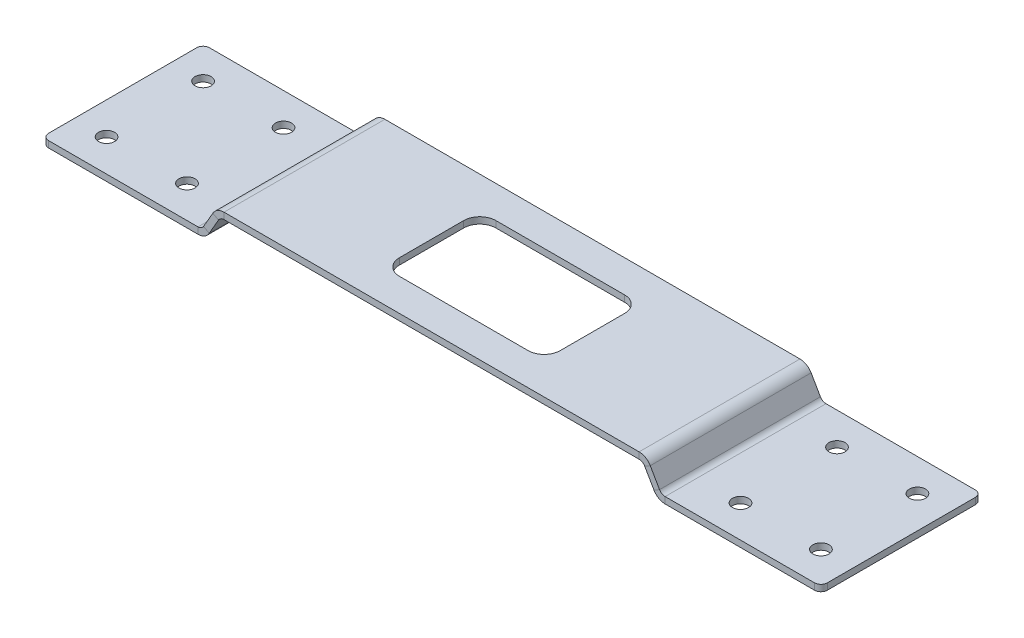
ISO-10303-21;
HEADER;
FILE_DESCRIPTION(('STEP AP214'),'2;1');
FILE_NAME('part.step','',(''),(''),'','','');
FILE_SCHEMA(('AUTOMOTIVE_DESIGN { 1 0 10303 214 1 1 1 1 }'));
ENDSEC;
DATA;
#1=APPLICATION_CONTEXT('core data for automotive mechanical design processes');
#2=APPLICATION_PROTOCOL_DEFINITION('international standard','automotive_design',2000,#1);
#3=PRODUCT_CONTEXT('',#1,'mechanical');
#4=PRODUCT('Part','Part','',(#3));
#5=PRODUCT_RELATED_PRODUCT_CATEGORY('part','',(#4));
#6=PRODUCT_DEFINITION_FORMATION('','',#4);
#7=PRODUCT_DEFINITION_CONTEXT('part definition',#1,'design');
#8=PRODUCT_DEFINITION('design','',#6,#7);
#9=PRODUCT_DEFINITION_SHAPE('','',#8);
#10=(LENGTH_UNIT() NAMED_UNIT(*) SI_UNIT(.MILLI.,.METRE.));
#11=(NAMED_UNIT(*) PLANE_ANGLE_UNIT() SI_UNIT($,.RADIAN.));
#12=(NAMED_UNIT(*) SI_UNIT($,.STERADIAN.) SOLID_ANGLE_UNIT());
#13=UNCERTAINTY_MEASURE_WITH_UNIT(LENGTH_MEASURE(1.E-05),#10,'distance_accuracy_value','');
#14=(GEOMETRIC_REPRESENTATION_CONTEXT(3) GLOBAL_UNCERTAINTY_ASSIGNED_CONTEXT((#13)) GLOBAL_UNIT_ASSIGNED_CONTEXT((#10,
#11,#12)) REPRESENTATION_CONTEXT('',''));
#15=CARTESIAN_POINT('',(0.,0.,0.));
#16=DIRECTION('',(0.,0.,1.));
#17=DIRECTION('',(1.,0.,0.));
#18=AXIS2_PLACEMENT_3D('',#15,#16,#17);
#19=CARTESIAN_POINT('',(0.,18.0000000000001,0.));
#20=DIRECTION('',(0.,1.,0.));
#21=DIRECTION('',(0.,0.,1.));
#22=AXIS2_PLACEMENT_3D('',#19,#20,#21);
#23=PLANE('',#22);
#24=CARTESIAN_POINT('',(20.,18.0000000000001,-10.));
#25=DIRECTION('',(0.,1.,0.));
#26=DIRECTION('',(0.,0.,1.));
#27=AXIS2_PLACEMENT_3D('',#24,#25,#26);
#28=CIRCLE('',#27,5.);
#29=CARTESIAN_POINT('',(25.,18.0000000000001,-9.99999999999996));
#30=VERTEX_POINT('',#29);
#31=CARTESIAN_POINT('',(20.,18.,-15.));
#32=VERTEX_POINT('',#31);
#33=EDGE_CURVE('E306',#30,#32,#28,.T.);
#34=ORIENTED_EDGE('',*,*,#33,.F.);
#35=DIRECTION('',(0.,0.,-1.));
#36=VECTOR('',#35,1.);
#37=CARTESIAN_POINT('',(25.,18.0000000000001,10.));
#38=LINE('',#37,#36);
#39=CARTESIAN_POINT('',(25.,18.0000000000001,10.));
#40=VERTEX_POINT('',#39);
#41=EDGE_CURVE('E310',#40,#30,#38,.T.);
#42=ORIENTED_EDGE('',*,*,#41,.F.);
#43=CARTESIAN_POINT('',(20.,18.0000000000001,10.));
#44=DIRECTION('',(0.,1.,0.));
#45=DIRECTION('',(0.,0.,1.));
#46=AXIS2_PLACEMENT_3D('',#43,#44,#45);
#47=CIRCLE('',#46,5.);
#48=CARTESIAN_POINT('',(20.,18.0000000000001,15.));
#49=VERTEX_POINT('',#48);
#50=EDGE_CURVE('E315',#49,#40,#47,.T.);
#51=ORIENTED_EDGE('',*,*,#50,.F.);
#52=DIRECTION('',(1.,0.,0.));
#53=VECTOR('',#52,1.);
#54=CARTESIAN_POINT('',(20.,18.0000000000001,15.));
#55=LINE('',#54,#53);
#56=CARTESIAN_POINT('',(-20.,18.0000000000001,15.));
#57=VERTEX_POINT('',#56);
#58=EDGE_CURVE('E320',#57,#49,#55,.T.);
#59=ORIENTED_EDGE('',*,*,#58,.F.);
#60=CARTESIAN_POINT('',(-20.,18.,10.));
#61=DIRECTION('',(0.,1.,0.));
#62=DIRECTION('',(0.,0.,-1.));
#63=AXIS2_PLACEMENT_3D('',#60,#61,#62);
#64=CIRCLE('',#63,5.);
#65=CARTESIAN_POINT('',(-25.,18.0000000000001,10.));
#66=VERTEX_POINT('',#65);
#67=EDGE_CURVE('E325',#66,#57,#64,.T.);
#68=ORIENTED_EDGE('',*,*,#67,.F.);
#69=DIRECTION('',(0.,0.,1.));
#70=VECTOR('',#69,1.);
#71=CARTESIAN_POINT('',(-25.,18.0000000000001,10.));
#72=LINE('',#71,#70);
#73=CARTESIAN_POINT('',(-25.,18.0000000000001,-9.99999999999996));
#74=VERTEX_POINT('',#73);
#75=EDGE_CURVE('E330',#74,#66,#72,.T.);
#76=ORIENTED_EDGE('',*,*,#75,.F.);
#77=CARTESIAN_POINT('',(-20.,18.0000000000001,-10.));
#78=DIRECTION('',(0.,1.,0.));
#79=DIRECTION('',(0.,0.,1.));
#80=AXIS2_PLACEMENT_3D('',#77,#78,#79);
#81=CIRCLE('',#80,5.);
#82=CARTESIAN_POINT('',(-19.9999999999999,18.,-15.));
#83=VERTEX_POINT('',#82);
#84=EDGE_CURVE('E335',#83,#74,#81,.T.);
#85=ORIENTED_EDGE('',*,*,#84,.F.);
#86=DIRECTION('',(-1.,0.,0.));
#87=VECTOR('',#86,1.);
#88=CARTESIAN_POINT('',(20.,18.,-15.));
#89=LINE('',#88,#87);
#90=EDGE_CURVE('E341',#32,#83,#89,.T.);
#91=ORIENTED_EDGE('',*,*,#90,.F.);
#92=EDGE_LOOP('',(#34,#42,#51,#59,#68,#76,#85,#91));
#93=FACE_BOUND('',#92,.T.);
#94=DIRECTION('',(1.,0.,0.));
#95=VECTOR('',#94,1.);
#96=CARTESIAN_POINT('',(125.,18.0000000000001,25.));
#97=LINE('',#96,#95);
#98=CARTESIAN_POINT('',(-64.514108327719,18.,25.));
#99=VERTEX_POINT('',#98);
#100=CARTESIAN_POINT('',(64.5141083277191,18.0000000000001,25.));
#101=VERTEX_POINT('',#100);
#102=EDGE_CURVE('E52',#99,#101,#97,.T.);
#103=ORIENTED_EDGE('',*,*,#102,.T.);
#104=DIRECTION('',(0.,0.,-1.));
#105=VECTOR('',#104,1.);
#106=CARTESIAN_POINT('',(64.5141083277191,18.0000000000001,0.));
#107=LINE('',#106,#105);
#108=CARTESIAN_POINT('',(64.5141083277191,18.0000000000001,-25.));
#109=VERTEX_POINT('',#108);
#110=EDGE_CURVE('E258',#101,#109,#107,.T.);
#111=ORIENTED_EDGE('',*,*,#110,.T.);
#112=DIRECTION('',(-1.,0.,0.));
#113=VECTOR('',#112,1.);
#114=CARTESIAN_POINT('',(125.,18.0000000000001,-25.));
#115=LINE('',#114,#113);
#116=CARTESIAN_POINT('',(-64.514108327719,18.,-25.));
#117=VERTEX_POINT('',#116);
#118=EDGE_CURVE('E283',#109,#117,#115,.T.);
#119=ORIENTED_EDGE('',*,*,#118,.T.);
#120=DIRECTION('',(0.,0.,-1.));
#121=VECTOR('',#120,1.);
#122=CARTESIAN_POINT('',(-64.514108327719,18.,0.));
#123=LINE('',#122,#121);
#124=EDGE_CURVE('E279',#99,#117,#123,.T.);
#125=ORIENTED_EDGE('',*,*,#124,.F.);
#126=EDGE_LOOP('',(#103,#111,#119,#125));
#127=FACE_BOUND('',#126,.T.);
#128=ADVANCED_FACE('F48',(#93,#127),#23,.T.);
#129=CARTESIAN_POINT('',(-34.1503594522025,74.5915557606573,0.));
#130=DIRECTION('',(-0.86602540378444,0.499999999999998,0.));
#131=DIRECTION('',(0.,0.,1.));
#132=AXIS2_PLACEMENT_3D('',#129,#130,#131);
#133=PLANE('',#132);
#134=DIRECTION('',(0.499999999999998,0.86602540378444,0.));
#135=VECTOR('',#134,1.);
#136=CARTESIAN_POINT('',(28.3496405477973,182.844731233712,25.0000000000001));
#137=LINE('',#136,#135);
#138=CARTESIAN_POINT('',(-70.8649612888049,11.,25.));
#139=VERTEX_POINT('',#138);
#140=CARTESIAN_POINT('',(-67.9782099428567,16.,25.));
#141=VERTEX_POINT('',#140);
#142=EDGE_CURVE('E464',#139,#141,#137,.T.);
#143=ORIENTED_EDGE('',*,*,#142,.T.);
#144=DIRECTION('',(0.,0.,-1.));
#145=VECTOR('',#144,1.);
#146=CARTESIAN_POINT('',(-67.9782099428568,16.,0.));
#147=LINE('',#146,#145);
#148=CARTESIAN_POINT('',(-67.9782099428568,16.,-24.9999999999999));
#149=VERTEX_POINT('',#148);
#150=EDGE_CURVE('E452',#141,#149,#147,.T.);
#151=ORIENTED_EDGE('',*,*,#150,.T.);
#152=DIRECTION('',(-0.499999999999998,-0.86602540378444,0.));
#153=VECTOR('',#152,1.);
#154=CARTESIAN_POINT('',(28.3496405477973,182.844731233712,-24.9999999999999));
#155=LINE('',#154,#153);
#156=CARTESIAN_POINT('',(-70.8649612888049,11.,-25.));
#157=VERTEX_POINT('',#156);
#158=EDGE_CURVE('E445',#149,#157,#155,.T.);
#159=ORIENTED_EDGE('',*,*,#158,.T.);
#160=DIRECTION('',(0.,0.,-1.));
#161=VECTOR('',#160,1.);
#162=CARTESIAN_POINT('',(-70.8649612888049,11.,0.));
#163=LINE('',#162,#161);
#164=EDGE_CURVE('E441',#139,#157,#163,.T.);
#165=ORIENTED_EDGE('',*,*,#164,.F.);
#166=EDGE_LOOP('',(#143,#151,#159,#165));
#167=FACE_BOUND('',#166,.T.);
#168=ADVANCED_FACE('F470',(#167),#133,.T.);
#169=CARTESIAN_POINT('',(-32.4183086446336,73.5915557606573,0.));
#170=DIRECTION('',(-0.86602540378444,0.499999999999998,0.));
#171=DIRECTION('',(0.,0.,1.));
#172=AXIS2_PLACEMENT_3D('',#169,#170,#171);
#173=PLANE('',#172);
#174=DIRECTION('',(0.,0.,-1.));
#175=VECTOR('',#174,1.);
#176=CARTESIAN_POINT('',(-66.2461591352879,15.,0.));
#177=LINE('',#176,#175);
#178=CARTESIAN_POINT('',(-66.2461591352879,15.,25.));
#179=VERTEX_POINT('',#178);
#180=CARTESIAN_POINT('',(-66.2461591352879,15.,-25.));
#181=VERTEX_POINT('',#180);
#182=EDGE_CURVE('E458',#179,#181,#177,.T.);
#183=ORIENTED_EDGE('',*,*,#182,.F.);
#184=DIRECTION('',(0.499999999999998,0.86602540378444,0.));
#185=VECTOR('',#184,1.);
#186=CARTESIAN_POINT('',(30.0816913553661,181.844731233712,25.0000000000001));
#187=LINE('',#186,#185);
#188=CARTESIAN_POINT('',(-69.132910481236,9.99999999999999,25.));
#189=VERTEX_POINT('',#188);
#190=EDGE_CURVE('E373',#189,#179,#187,.T.);
#191=ORIENTED_EDGE('',*,*,#190,.F.);
#192=DIRECTION('',(0.,0.,-1.));
#193=VECTOR('',#192,1.);
#194=CARTESIAN_POINT('',(-69.132910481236,10.,0.));
#195=LINE('',#194,#193);
#196=CARTESIAN_POINT('',(-69.132910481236,10.,-25.));
#197=VERTEX_POINT('',#196);
#198=EDGE_CURVE('E447',#189,#197,#195,.T.);
#199=ORIENTED_EDGE('',*,*,#198,.T.);
#200=DIRECTION('',(-0.499999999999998,-0.86602540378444,0.));
#201=VECTOR('',#200,1.);
#202=CARTESIAN_POINT('',(30.0816913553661,181.844731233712,-24.9999999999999));
#203=LINE('',#202,#201);
#204=EDGE_CURVE('E72',#181,#197,#203,.T.);
#205=ORIENTED_EDGE('',*,*,#204,.F.);
#206=EDGE_LOOP('',(#183,#191,#199,#205));
#207=FACE_BOUND('',#206,.T.);
#208=ADVANCED_FACE('F553',(#207),#173,.F.);
#209=CARTESIAN_POINT('',(28.3496405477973,182.844731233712,-24.9999999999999));
#210=DIRECTION('',(0.,0.,1.));
#211=DIRECTION('',(0.499999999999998,0.86602540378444,0.));
#212=AXIS2_PLACEMENT_3D('',#209,#210,#211);
#213=PLANE('',#212);
#214=DIRECTION('',(-0.86602540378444,0.499999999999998,0.));
#215=VECTOR('',#214,1.);
#216=CARTESIAN_POINT('',(-67.9782099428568,16.,-25.));
#217=LINE('',#216,#215);
#218=EDGE_CURVE('E267',#181,#149,#217,.T.);
#219=ORIENTED_EDGE('',*,*,#218,.F.);
#220=ORIENTED_EDGE('',*,*,#204,.T.);
#221=DIRECTION('',(-0.86602540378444,0.499999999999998,0.));
#222=VECTOR('',#221,1.);
#223=CARTESIAN_POINT('',(-70.8649612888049,11.,-25.));
#224=LINE('',#223,#222);
#225=EDGE_CURVE('E444',#197,#157,#224,.T.);
#226=ORIENTED_EDGE('',*,*,#225,.T.);
#227=ORIENTED_EDGE('',*,*,#158,.F.);
#228=EDGE_LOOP('',(#219,#220,#226,#227));
#229=FACE_BOUND('',#228,.T.);
#230=ADVANCED_FACE('F557',(#229),#213,.F.);
#231=CARTESIAN_POINT('',(28.3496405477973,182.844731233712,25.0000000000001));
#232=DIRECTION('',(0.,0.,-1.));
#233=DIRECTION('',(-0.499999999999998,-0.86602540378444,0.));
#234=AXIS2_PLACEMENT_3D('',#231,#232,#233);
#235=PLANE('',#234);
#236=DIRECTION('',(0.86602540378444,-0.499999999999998,0.));
#237=VECTOR('',#236,1.);
#238=CARTESIAN_POINT('',(-67.9782099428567,16.,25.));
#239=LINE('',#238,#237);
#240=EDGE_CURVE('E455',#141,#179,#239,.T.);
#241=ORIENTED_EDGE('',*,*,#240,.F.);
#242=ORIENTED_EDGE('',*,*,#142,.F.);
#243=DIRECTION('',(0.86602540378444,-0.499999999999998,0.));
#244=VECTOR('',#243,1.);
#245=CARTESIAN_POINT('',(-70.8649612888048,11.,25.));
#246=LINE('',#245,#244);
#247=EDGE_CURVE('E449',#139,#189,#246,.T.);
#248=ORIENTED_EDGE('',*,*,#247,.T.);
#249=ORIENTED_EDGE('',*,*,#190,.T.);
#250=EDGE_LOOP('',(#241,#242,#248,#249));
#251=FACE_BOUND('',#250,.T.);
#252=ADVANCED_FACE('F474',(#251),#235,.F.);
#253=CARTESIAN_POINT('',(-119.026215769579,10.,23.));
#254=DIRECTION('',(0.,-1.,0.));
#255=DIRECTION('',(0.,0.,-1.));
#256=AXIS2_PLACEMENT_3D('',#253,#254,#255);
#257=CYLINDRICAL_SURFACE('',#256,2.);
#258=CARTESIAN_POINT('',(-119.026215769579,10.,23.));
#259=DIRECTION('',(0.,1.,0.));
#260=DIRECTION('',(0.,0.,1.));
#261=AXIS2_PLACEMENT_3D('',#258,#259,#260);
#262=CIRCLE('',#261,2.);
#263=CARTESIAN_POINT('',(-121.026215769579,10.,23.));
#264=VERTEX_POINT('',#263);
#265=CARTESIAN_POINT('',(-119.026215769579,10.,25.));
#266=VERTEX_POINT('',#265);
#267=EDGE_CURVE('E399',#264,#266,#262,.T.);
#268=ORIENTED_EDGE('',*,*,#267,.F.);
#269=DIRECTION('',(0.,-1.,0.));
#270=VECTOR('',#269,1.);
#271=CARTESIAN_POINT('',(-121.026215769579,10.,23.));
#272=LINE('',#271,#270);
#273=CARTESIAN_POINT('',(-121.026215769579,8.00000000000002,23.));
#274=VERTEX_POINT('',#273);
#275=EDGE_CURVE('E425',#274,#264,#272,.F.);
#276=ORIENTED_EDGE('',*,*,#275,.F.);
#277=CARTESIAN_POINT('',(-119.026215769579,8.00000000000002,23.));
#278=DIRECTION('',(0.,1.,0.));
#279=DIRECTION('',(0.,0.,1.));
#280=AXIS2_PLACEMENT_3D('',#277,#278,#279);
#281=CIRCLE('',#280,2.);
#282=CARTESIAN_POINT('',(-119.026215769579,8.00000000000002,25.));
#283=VERTEX_POINT('',#282);
#284=EDGE_CURVE('E392',#283,#274,#281,.F.);
#285=ORIENTED_EDGE('',*,*,#284,.F.);
#286=DIRECTION('',(0.,-1.,0.));
#287=VECTOR('',#286,1.);
#288=CARTESIAN_POINT('',(-119.026215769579,10.,25.));
#289=LINE('',#288,#287);
#290=EDGE_CURVE('E374',#266,#283,#289,.T.);
#291=ORIENTED_EDGE('',*,*,#290,.F.);
#292=EDGE_LOOP('',(#268,#276,#285,#291));
#293=FACE_BOUND('',#292,.T.);
#294=ADVANCED_FACE('F799',(#293),#257,.T.);
#295=CARTESIAN_POINT('',(-121.026215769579,10.,25.));
#296=DIRECTION('',(1.,0.,0.));
#297=DIRECTION('',(0.,0.,-1.));
#298=AXIS2_PLACEMENT_3D('',#295,#296,#297);
#299=PLANE('',#298);
#300=DIRECTION('',(0.,0.,1.));
#301=VECTOR('',#300,1.);
#302=CARTESIAN_POINT('',(-121.026215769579,10.,25.));
#303=LINE('',#302,#301);
#304=CARTESIAN_POINT('',(-121.026215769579,10.,-23.));
#305=VERTEX_POINT('',#304);
#306=EDGE_CURVE('E401',#305,#264,#303,.T.);
#307=ORIENTED_EDGE('',*,*,#306,.F.);
#308=DIRECTION('',(0.,-1.,0.));
#309=VECTOR('',#308,1.);
#310=CARTESIAN_POINT('',(-121.026215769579,10.,-23.));
#311=LINE('',#310,#309);
#312=CARTESIAN_POINT('',(-121.026215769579,8.00000000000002,-23.));
#313=VERTEX_POINT('',#312);
#314=EDGE_CURVE('E430',#305,#313,#311,.T.);
#315=ORIENTED_EDGE('',*,*,#314,.T.);
#316=DIRECTION('',(0.,0.,1.));
#317=VECTOR('',#316,1.);
#318=CARTESIAN_POINT('',(-121.026215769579,8.00000000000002,25.));
#319=LINE('',#318,#317);
#320=EDGE_CURVE('E427',#313,#274,#319,.T.);
#321=ORIENTED_EDGE('',*,*,#320,.T.);
#322=ORIENTED_EDGE('',*,*,#275,.T.);
#323=EDGE_LOOP('',(#307,#315,#321,#322));
#324=FACE_BOUND('',#323,.T.);
#325=ADVANCED_FACE('F802',(#324),#299,.F.);
#326=CARTESIAN_POINT('',(-119.026215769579,10.,-23.));
#327=DIRECTION('',(0.,-1.,0.));
#328=DIRECTION('',(0.,0.,-1.));
#329=AXIS2_PLACEMENT_3D('',#326,#327,#328);
#330=CYLINDRICAL_SURFACE('',#329,2.);
#331=CARTESIAN_POINT('',(-119.026215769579,10.,-23.));
#332=DIRECTION('',(0.,1.,0.));
#333=DIRECTION('',(0.,0.,1.));
#334=AXIS2_PLACEMENT_3D('',#331,#332,#333);
#335=CIRCLE('',#334,2.);
#336=CARTESIAN_POINT('',(-119.026215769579,10.,-25.));
#337=VERTEX_POINT('',#336);
#338=EDGE_CURVE('E404',#337,#305,#335,.T.);
#339=ORIENTED_EDGE('',*,*,#338,.F.);
#340=DIRECTION('',(0.,-1.,0.));
#341=VECTOR('',#340,1.);
#342=CARTESIAN_POINT('',(-119.026215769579,10.,-25.));
#343=LINE('',#342,#341);
#344=CARTESIAN_POINT('',(-119.026215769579,8.00000000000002,-25.));
#345=VERTEX_POINT('',#344);
#346=EDGE_CURVE('E394',#345,#337,#343,.F.);
#347=ORIENTED_EDGE('',*,*,#346,.F.);
#348=CARTESIAN_POINT('',(-119.026215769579,8.00000000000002,-23.));
#349=DIRECTION('',(0.,1.,0.));
#350=DIRECTION('',(0.,0.,1.));
#351=AXIS2_PLACEMENT_3D('',#348,#349,#350);
#352=CIRCLE('',#351,2.);
#353=EDGE_CURVE('E389',#313,#345,#352,.F.);
#354=ORIENTED_EDGE('',*,*,#353,.F.);
#355=ORIENTED_EDGE('',*,*,#314,.F.);
#356=EDGE_LOOP('',(#339,#347,#354,#355));
#357=FACE_BOUND('',#356,.T.);
#358=ADVANCED_FACE('F806',(#357),#330,.T.);
#359=CARTESIAN_POINT('',(-111.026215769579,10.,15.));
#360=DIRECTION('',(0.,1.,0.));
#361=DIRECTION('',(0.,0.,1.));
#362=AXIS2_PLACEMENT_3D('',#359,#360,#361);
#363=CYLINDRICAL_SURFACE('',#362,2.5);
#364=CARTESIAN_POINT('',(-111.026215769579,8.00000000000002,15.));
#365=DIRECTION('',(0.,1.,0.));
#366=DIRECTION('',(0.,0.,1.));
#367=AXIS2_PLACEMENT_3D('',#364,#365,#366);
#368=CIRCLE('',#367,2.5);
#369=CARTESIAN_POINT('',(-111.026215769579,8.00000000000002,17.5));
#370=VERTEX_POINT('',#369);
#371=EDGE_CURVE('E386',#370,#370,#368,.T.);
#372=ORIENTED_EDGE('',*,*,#371,.F.);
#373=EDGE_LOOP('',(#372));
#374=FACE_BOUND('',#373,.T.);
#375=CARTESIAN_POINT('',(-111.026215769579,10.,15.));
#376=DIRECTION('',(0.,1.,0.));
#377=DIRECTION('',(0.,0.,1.));
#378=AXIS2_PLACEMENT_3D('',#375,#376,#377);
#379=CIRCLE('',#378,2.5);
#380=CARTESIAN_POINT('',(-111.026215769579,10.,17.5));
#381=VERTEX_POINT('',#380);
#382=EDGE_CURVE('E422',#381,#381,#379,.T.);
#383=ORIENTED_EDGE('',*,*,#382,.T.);
#384=EDGE_LOOP('',(#383));
#385=FACE_BOUND('',#384,.T.);
#386=ADVANCED_FACE('F810',(#374,#385),#363,.F.);
#387=CARTESIAN_POINT('',(-86.0262157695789,10.,-15.));
#388=DIRECTION('',(0.,1.,0.));
#389=DIRECTION('',(0.,0.,1.));
#390=AXIS2_PLACEMENT_3D('',#387,#388,#389);
#391=CYLINDRICAL_SURFACE('',#390,2.5);
#392=CARTESIAN_POINT('',(-86.0262157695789,8.00000000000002,-15.));
#393=DIRECTION('',(0.,1.,0.));
#394=DIRECTION('',(0.,0.,1.));
#395=AXIS2_PLACEMENT_3D('',#392,#393,#394);
#396=CIRCLE('',#395,2.5);
#397=CARTESIAN_POINT('',(-86.0262157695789,8.00000000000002,-12.5));
#398=VERTEX_POINT('',#397);
#399=EDGE_CURVE('E383',#398,#398,#396,.T.);
#400=ORIENTED_EDGE('',*,*,#399,.F.);
#401=EDGE_LOOP('',(#400));
#402=FACE_BOUND('',#401,.T.);
#403=CARTESIAN_POINT('',(-86.0262157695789,10.,-15.));
#404=DIRECTION('',(0.,1.,0.));
#405=DIRECTION('',(0.,0.,1.));
#406=AXIS2_PLACEMENT_3D('',#403,#404,#405);
#407=CIRCLE('',#406,2.5);
#408=CARTESIAN_POINT('',(-86.0262157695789,10.,-12.5));
#409=VERTEX_POINT('',#408);
#410=EDGE_CURVE('E419',#409,#409,#407,.T.);
#411=ORIENTED_EDGE('',*,*,#410,.T.);
#412=EDGE_LOOP('',(#411));
#413=FACE_BOUND('',#412,.T.);
#414=ADVANCED_FACE('F814',(#402,#413),#391,.F.);
#415=CARTESIAN_POINT('',(-111.026215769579,10.,-15.));
#416=DIRECTION('',(0.,1.,0.));
#417=DIRECTION('',(0.,0.,1.));
#418=AXIS2_PLACEMENT_3D('',#415,#416,#417);
#419=CYLINDRICAL_SURFACE('',#418,2.5);
#420=CARTESIAN_POINT('',(-111.026215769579,8.00000000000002,-15.));
#421=DIRECTION('',(0.,1.,0.));
#422=DIRECTION('',(0.,0.,1.));
#423=AXIS2_PLACEMENT_3D('',#420,#421,#422);
#424=CIRCLE('',#423,2.5);
#425=CARTESIAN_POINT('',(-111.026215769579,8.00000000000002,-12.5));
#426=VERTEX_POINT('',#425);
#427=EDGE_CURVE('E380',#426,#426,#424,.T.);
#428=ORIENTED_EDGE('',*,*,#427,.F.);
#429=EDGE_LOOP('',(#428));
#430=FACE_BOUND('',#429,.T.);
#431=CARTESIAN_POINT('',(-111.026215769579,10.,-15.));
#432=DIRECTION('',(0.,1.,0.));
#433=DIRECTION('',(0.,0.,1.));
#434=AXIS2_PLACEMENT_3D('',#431,#432,#433);
#435=CIRCLE('',#434,2.5);
#436=CARTESIAN_POINT('',(-111.026215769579,10.,-12.5));
#437=VERTEX_POINT('',#436);
#438=EDGE_CURVE('E416',#437,#437,#435,.T.);
#439=ORIENTED_EDGE('',*,*,#438,.T.);
#440=EDGE_LOOP('',(#439));
#441=FACE_BOUND('',#440,.T.);
#442=ADVANCED_FACE('F818',(#430,#441),#419,.F.);
#443=CARTESIAN_POINT('',(-86.0262157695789,10.,15.));
#444=DIRECTION('',(0.,1.,0.));
#445=DIRECTION('',(0.,0.,1.));
#446=AXIS2_PLACEMENT_3D('',#443,#444,#445);
#447=CYLINDRICAL_SURFACE('',#446,2.5);
#448=CARTESIAN_POINT('',(-86.0262157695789,8.00000000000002,15.));
#449=DIRECTION('',(0.,1.,0.));
#450=DIRECTION('',(0.,0.,1.));
#451=AXIS2_PLACEMENT_3D('',#448,#449,#450);
#452=CIRCLE('',#451,2.5);
#453=CARTESIAN_POINT('',(-86.0262157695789,8.00000000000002,17.5));
#454=VERTEX_POINT('',#453);
#455=EDGE_CURVE('E377',#454,#454,#452,.T.);
#456=ORIENTED_EDGE('',*,*,#455,.F.);
#457=EDGE_LOOP('',(#456));
#458=FACE_BOUND('',#457,.T.);
#459=CARTESIAN_POINT('',(-86.0262157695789,10.,15.));
#460=DIRECTION('',(0.,1.,0.));
#461=DIRECTION('',(0.,0.,1.));
#462=AXIS2_PLACEMENT_3D('',#459,#460,#461);
#463=CIRCLE('',#462,2.5);
#464=CARTESIAN_POINT('',(-86.0262157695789,10.,17.5));
#465=VERTEX_POINT('',#464);
#466=EDGE_CURVE('E413',#465,#465,#463,.T.);
#467=ORIENTED_EDGE('',*,*,#466,.T.);
#468=EDGE_LOOP('',(#467));
#469=FACE_BOUND('',#468,.T.);
#470=ADVANCED_FACE('F822',(#458,#469),#447,.F.);
#471=CARTESIAN_POINT('',(3.97378423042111,10.,0.));
#472=DIRECTION('',(0.,1.,0.));
#473=DIRECTION('',(0.,0.,1.));
#474=AXIS2_PLACEMENT_3D('',#471,#472,#473);
#475=PLANE('',#474);
#476=ORIENTED_EDGE('',*,*,#466,.F.);
#477=EDGE_LOOP('',(#476));
#478=FACE_BOUND('',#477,.T.);
#479=ORIENTED_EDGE('',*,*,#438,.F.);
#480=EDGE_LOOP('',(#479));
#481=FACE_BOUND('',#480,.T.);
#482=ORIENTED_EDGE('',*,*,#410,.F.);
#483=EDGE_LOOP('',(#482));
#484=FACE_BOUND('',#483,.T.);
#485=ORIENTED_EDGE('',*,*,#382,.F.);
#486=EDGE_LOOP('',(#485));
#487=FACE_BOUND('',#486,.T.);
#488=DIRECTION('',(1.,0.,0.));
#489=VECTOR('',#488,1.);
#490=CARTESIAN_POINT('',(128.973784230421,10.,25.));
#491=LINE('',#490,#489);
#492=CARTESIAN_POINT('',(-72.5970120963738,10.,25.));
#493=VERTEX_POINT('',#492);
#494=EDGE_CURVE('E411',#266,#493,#491,.T.);
#495=ORIENTED_EDGE('',*,*,#494,.T.);
#496=DIRECTION('',(0.,0.,-1.));
#497=VECTOR('',#496,1.);
#498=CARTESIAN_POINT('',(-72.5970120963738,10.,0.));
#499=LINE('',#498,#497);
#500=CARTESIAN_POINT('',(-72.5970120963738,10.,-25.));
#501=VERTEX_POINT('',#500);
#502=EDGE_CURVE('E408',#493,#501,#499,.T.);
#503=ORIENTED_EDGE('',*,*,#502,.T.);
#504=DIRECTION('',(-1.,0.,0.));
#505=VECTOR('',#504,1.);
#506=CARTESIAN_POINT('',(128.973784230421,10.,-25.));
#507=LINE('',#506,#505);
#508=EDGE_CURVE('E406',#501,#337,#507,.T.);
#509=ORIENTED_EDGE('',*,*,#508,.T.);
#510=ORIENTED_EDGE('',*,*,#338,.T.);
#511=ORIENTED_EDGE('',*,*,#306,.T.);
#512=ORIENTED_EDGE('',*,*,#267,.T.);
#513=EDGE_LOOP('',(#495,#503,#509,#510,#511,#512));
#514=FACE_BOUND('',#513,.T.);
#515=ADVANCED_FACE('F826',(#478,#481,#484,#487,#514),#475,.T.);
#516=CARTESIAN_POINT('',(128.973784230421,10.,-25.));
#517=DIRECTION('',(0.,0.,1.));
#518=DIRECTION('',(1.,0.,0.));
#519=AXIS2_PLACEMENT_3D('',#516,#517,#518);
#520=PLANE('',#519);
#521=DIRECTION('',(0.,1.,0.));
#522=VECTOR('',#521,1.);
#523=CARTESIAN_POINT('',(-72.5970120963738,10.,-25.));
#524=LINE('',#523,#522);
#525=CARTESIAN_POINT('',(-72.5970120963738,8.00000000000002,-25.));
#526=VERTEX_POINT('',#525);
#527=EDGE_CURVE('E433',#526,#501,#524,.T.);
#528=ORIENTED_EDGE('',*,*,#527,.F.);
#529=DIRECTION('',(-1.,0.,0.));
#530=VECTOR('',#529,1.);
#531=CARTESIAN_POINT('',(128.973784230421,8.00000000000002,-25.));
#532=LINE('',#531,#530);
#533=EDGE_CURVE('E397',#526,#345,#532,.T.);
#534=ORIENTED_EDGE('',*,*,#533,.T.);
#535=ORIENTED_EDGE('',*,*,#346,.T.);
#536=ORIENTED_EDGE('',*,*,#508,.F.);
#537=EDGE_LOOP('',(#528,#534,#535,#536));
#538=FACE_BOUND('',#537,.T.);
#539=ADVANCED_FACE('F830',(#538),#520,.F.);
#540=CARTESIAN_POINT('',(3.97378423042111,8.00000000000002,0.));
#541=DIRECTION('',(0.,1.,0.));
#542=DIRECTION('',(0.,0.,1.));
#543=AXIS2_PLACEMENT_3D('',#540,#541,#542);
#544=PLANE('',#543);
#545=DIRECTION('',(0.,0.,-1.));
#546=VECTOR('',#545,1.);
#547=CARTESIAN_POINT('',(-72.5970120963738,8.00000000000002,0.));
#548=LINE('',#547,#546);
#549=CARTESIAN_POINT('',(-72.5970120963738,8.00000000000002,25.));
#550=VERTEX_POINT('',#549);
#551=EDGE_CURVE('E436',#550,#526,#548,.T.);
#552=ORIENTED_EDGE('',*,*,#551,.F.);
#553=DIRECTION('',(1.,0.,0.));
#554=VECTOR('',#553,1.);
#555=CARTESIAN_POINT('',(128.973784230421,8.00000000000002,25.));
#556=LINE('',#555,#554);
#557=EDGE_CURVE('E371',#283,#550,#556,.T.);
#558=ORIENTED_EDGE('',*,*,#557,.F.);
#559=ORIENTED_EDGE('',*,*,#284,.T.);
#560=ORIENTED_EDGE('',*,*,#320,.F.);
#561=ORIENTED_EDGE('',*,*,#353,.T.);
#562=ORIENTED_EDGE('',*,*,#533,.F.);
#563=EDGE_LOOP('',(#552,#558,#559,#560,#561,#562));
#564=FACE_BOUND('',#563,.T.);
#565=ORIENTED_EDGE('',*,*,#371,.T.);
#566=EDGE_LOOP('',(#565));
#567=FACE_BOUND('',#566,.T.);
#568=ORIENTED_EDGE('',*,*,#399,.T.);
#569=EDGE_LOOP('',(#568));
#570=FACE_BOUND('',#569,.T.);
#571=ORIENTED_EDGE('',*,*,#427,.T.);
#572=EDGE_LOOP('',(#571));
#573=FACE_BOUND('',#572,.T.);
#574=ORIENTED_EDGE('',*,*,#455,.T.);
#575=EDGE_LOOP('',(#574));
#576=FACE_BOUND('',#575,.T.);
#577=ADVANCED_FACE('F834',(#564,#567,#570,#573,#576),#544,.F.);
#578=CARTESIAN_POINT('',(128.973784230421,10.,25.));
#579=DIRECTION('',(0.,0.,-1.));
#580=DIRECTION('',(-1.,0.,0.));
#581=AXIS2_PLACEMENT_3D('',#578,#579,#580);
#582=PLANE('',#581);
#583=DIRECTION('',(0.,-1.,0.));
#584=VECTOR('',#583,1.);
#585=CARTESIAN_POINT('',(-72.5970120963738,10.,25.));
#586=LINE('',#585,#584);
#587=EDGE_CURVE('E366',#493,#550,#586,.T.);
#588=ORIENTED_EDGE('',*,*,#587,.F.);
#589=ORIENTED_EDGE('',*,*,#494,.F.);
#590=ORIENTED_EDGE('',*,*,#290,.T.);
#591=ORIENTED_EDGE('',*,*,#557,.T.);
#592=EDGE_LOOP('',(#588,#589,#590,#591));
#593=FACE_BOUND('',#592,.T.);
#594=ADVANCED_FACE('F794',(#593),#582,.F.);
#595=CARTESIAN_POINT('',(-72.5970120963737,12.,25.));
#596=DIRECTION('',(0.,0.,-1.));
#597=DIRECTION('',(-1.,0.,0.));
#598=AXIS2_PLACEMENT_3D('',#595,#596,#597);
#599=PLANE('',#598);
#600=ORIENTED_EDGE('',*,*,#587,.T.);
#601=CARTESIAN_POINT('',(-72.5970120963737,12.,25.));
#602=DIRECTION('',(0.,0.,-1.));
#603=DIRECTION('',(-1.,0.,0.));
#604=AXIS2_PLACEMENT_3D('',#601,#602,#603);
#605=CIRCLE('',#604,4.);
#606=EDGE_CURVE('E353',#550,#189,#605,.F.);
#607=ORIENTED_EDGE('',*,*,#606,.T.);
#608=ORIENTED_EDGE('',*,*,#247,.F.);
#609=CARTESIAN_POINT('',(-72.5970120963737,12.,25.));
#610=DIRECTION('',(0.,0.,1.));
#611=DIRECTION('',(1.,0.,0.));
#612=AXIS2_PLACEMENT_3D('',#609,#610,#611);
#613=CIRCLE('',#612,2.);
#614=EDGE_CURVE('E359',#493,#139,#613,.T.);
#615=ORIENTED_EDGE('',*,*,#614,.F.);
#616=EDGE_LOOP('',(#600,#607,#608,#615));
#617=FACE_BOUND('',#616,.T.);
#618=ADVANCED_FACE('F791',(#617),#599,.F.);
#619=CARTESIAN_POINT('',(-72.5970120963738,12.,-25.));
#620=DIRECTION('',(0.,0.,1.));
#621=DIRECTION('',(1.,0.,0.));
#622=AXIS2_PLACEMENT_3D('',#619,#620,#621);
#623=PLANE('',#622);
#624=CARTESIAN_POINT('',(-72.5970120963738,12.,-25.));
#625=DIRECTION('',(0.,0.,-1.));
#626=DIRECTION('',(-1.,0.,0.));
#627=AXIS2_PLACEMENT_3D('',#624,#625,#626);
#628=CIRCLE('',#627,4.);
#629=EDGE_CURVE('E363',#197,#526,#628,.T.);
#630=ORIENTED_EDGE('',*,*,#629,.T.);
#631=ORIENTED_EDGE('',*,*,#527,.T.);
#632=CARTESIAN_POINT('',(-72.5970120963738,12.,-25.));
#633=DIRECTION('',(0.,0.,-1.));
#634=DIRECTION('',(-1.,0.,0.));
#635=AXIS2_PLACEMENT_3D('',#632,#633,#634);
#636=CIRCLE('',#635,2.);
#637=EDGE_CURVE('E362',#157,#501,#636,.T.);
#638=ORIENTED_EDGE('',*,*,#637,.F.);
#639=ORIENTED_EDGE('',*,*,#225,.F.);
#640=EDGE_LOOP('',(#630,#631,#638,#639));
#641=FACE_BOUND('',#640,.T.);
#642=ADVANCED_FACE('F786',(#641),#623,.F.);
#643=CARTESIAN_POINT('',(-72.5970120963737,12.,50.1385042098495));
#644=DIRECTION('',(0.,0.,-1.));
#645=DIRECTION('',(-1.,0.,0.));
#646=AXIS2_PLACEMENT_3D('',#643,#644,#645);
#647=CYLINDRICAL_SURFACE('',#646,2.);
#648=ORIENTED_EDGE('',*,*,#164,.T.);
#649=ORIENTED_EDGE('',*,*,#637,.T.);
#650=ORIENTED_EDGE('',*,*,#502,.F.);
#651=ORIENTED_EDGE('',*,*,#614,.T.);
#652=EDGE_LOOP('',(#648,#649,#650,#651));
#653=FACE_BOUND('',#652,.T.);
#654=ADVANCED_FACE('F783',(#653),#647,.F.);
#655=CARTESIAN_POINT('',(-72.5970120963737,12.,50.1385042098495));
#656=DIRECTION('',(0.,0.,-1.));
#657=DIRECTION('',(-1.,0.,0.));
#658=AXIS2_PLACEMENT_3D('',#655,#656,#657);
#659=CYLINDRICAL_SURFACE('',#658,4.);
#660=ORIENTED_EDGE('',*,*,#198,.F.);
#661=ORIENTED_EDGE('',*,*,#606,.F.);
#662=ORIENTED_EDGE('',*,*,#551,.T.);
#663=ORIENTED_EDGE('',*,*,#629,.F.);
#664=EDGE_LOOP('',(#660,#661,#662,#663));
#665=FACE_BOUND('',#664,.T.);
#666=ADVANCED_FACE('F779',(#665),#659,.T.);
#667=CARTESIAN_POINT('',(-64.514108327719,14.,25.));
#668=DIRECTION('',(0.,0.,1.));
#669=DIRECTION('',(1.,0.,0.));
#670=AXIS2_PLACEMENT_3D('',#667,#668,#669);
#671=PLANE('',#670);
#672=ORIENTED_EDGE('',*,*,#240,.T.);
#673=CARTESIAN_POINT('',(-64.514108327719,14.,25.));
#674=DIRECTION('',(0.,0.,-1.));
#675=DIRECTION('',(-1.,0.,0.));
#676=AXIS2_PLACEMENT_3D('',#673,#674,#675);
#677=CIRCLE('',#676,2.);
#678=CARTESIAN_POINT('',(-64.514108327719,16.0000000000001,25.));
#679=VERTEX_POINT('',#678);
#680=EDGE_CURVE('E354',#179,#679,#677,.T.);
#681=ORIENTED_EDGE('',*,*,#680,.T.);
#682=DIRECTION('',(0.,-1.,0.));
#683=VECTOR('',#682,1.);
#684=CARTESIAN_POINT('',(-64.514108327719,18.,25.));
#685=LINE('',#684,#683);
#686=EDGE_CURVE('E298',#99,#679,#685,.T.);
#687=ORIENTED_EDGE('',*,*,#686,.F.);
#688=CARTESIAN_POINT('',(-64.514108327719,14.,25.));
#689=DIRECTION('',(0.,0.,-1.));
#690=DIRECTION('',(-1.,0.,0.));
#691=AXIS2_PLACEMENT_3D('',#688,#689,#690);
#692=CIRCLE('',#691,4.);
#693=EDGE_CURVE('E346',#141,#99,#692,.T.);
#694=ORIENTED_EDGE('',*,*,#693,.F.);
#695=EDGE_LOOP('',(#672,#681,#687,#694));
#696=FACE_BOUND('',#695,.T.);
#697=ADVANCED_FACE('F481',(#696),#671,.T.);
#698=CARTESIAN_POINT('',(-64.514108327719,14.,-25.));
#699=DIRECTION('',(0.,0.,-1.));
#700=DIRECTION('',(-1.,0.,0.));
#701=AXIS2_PLACEMENT_3D('',#698,#699,#700);
#702=PLANE('',#701);
#703=CARTESIAN_POINT('',(-64.514108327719,14.,-25.));
#704=DIRECTION('',(0.,0.,-1.));
#705=DIRECTION('',(-1.,0.,0.));
#706=AXIS2_PLACEMENT_3D('',#703,#704,#705);
#707=CIRCLE('',#706,2.);
#708=CARTESIAN_POINT('',(-64.514108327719,16.0000000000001,-25.));
#709=VERTEX_POINT('',#708);
#710=EDGE_CURVE('E350',#709,#181,#707,.F.);
#711=ORIENTED_EDGE('',*,*,#710,.T.);
#712=ORIENTED_EDGE('',*,*,#218,.T.);
#713=CARTESIAN_POINT('',(-64.514108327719,14.,-25.));
#714=DIRECTION('',(0.,0.,1.));
#715=DIRECTION('',(1.,0.,0.));
#716=AXIS2_PLACEMENT_3D('',#713,#714,#715);
#717=CIRCLE('',#716,4.);
#718=EDGE_CURVE('E349',#117,#149,#717,.T.);
#719=ORIENTED_EDGE('',*,*,#718,.F.);
#720=DIRECTION('',(0.,1.,0.));
#721=VECTOR('',#720,1.);
#722=CARTESIAN_POINT('',(-64.514108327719,18.,-25.));
#723=LINE('',#722,#721);
#724=EDGE_CURVE('E295',#709,#117,#723,.T.);
#725=ORIENTED_EDGE('',*,*,#724,.F.);
#726=EDGE_LOOP('',(#711,#712,#719,#725));
#727=FACE_BOUND('',#726,.T.);
#728=ADVANCED_FACE('F774',(#727),#702,.T.);
#729=CARTESIAN_POINT('',(-64.514108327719,14.,50.2469143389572));
#730=DIRECTION('',(0.,0.,-1.));
#731=DIRECTION('',(-1.,0.,0.));
#732=AXIS2_PLACEMENT_3D('',#729,#730,#731);
#733=CYLINDRICAL_SURFACE('',#732,4.);
#734=ORIENTED_EDGE('',*,*,#124,.T.);
#735=ORIENTED_EDGE('',*,*,#718,.T.);
#736=ORIENTED_EDGE('',*,*,#150,.F.);
#737=ORIENTED_EDGE('',*,*,#693,.T.);
#738=EDGE_LOOP('',(#734,#735,#736,#737));
#739=FACE_BOUND('',#738,.T.);
#740=ADVANCED_FACE('F479',(#739),#733,.T.);
#741=CARTESIAN_POINT('',(-64.514108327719,14.,50.2469143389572));
#742=DIRECTION('',(0.,0.,-1.));
#743=DIRECTION('',(-1.,0.,0.));
#744=AXIS2_PLACEMENT_3D('',#741,#742,#743);
#745=CYLINDRICAL_SURFACE('',#744,2.);
#746=DIRECTION('',(0.,0.,-1.));
#747=VECTOR('',#746,1.);
#748=CARTESIAN_POINT('',(-64.514108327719,16.,0.));
#749=LINE('',#748,#747);
#750=EDGE_CURVE('E296',#679,#709,#749,.T.);
#751=ORIENTED_EDGE('',*,*,#750,.F.);
#752=ORIENTED_EDGE('',*,*,#680,.F.);
#753=ORIENTED_EDGE('',*,*,#182,.T.);
#754=ORIENTED_EDGE('',*,*,#710,.F.);
#755=EDGE_LOOP('',(#751,#752,#753,#754));
#756=FACE_BOUND('',#755,.T.);
#757=ADVANCED_FACE('F483',(#756),#745,.F.);
#758=CARTESIAN_POINT('',(20.,16.,-15.));
#759=DIRECTION('',(0.,0.,-1.));
#760=DIRECTION('',(-1.,0.,0.));
#761=AXIS2_PLACEMENT_3D('',#758,#759,#760);
#762=PLANE('',#761);
#763=ORIENTED_EDGE('',*,*,#90,.T.);
#764=DIRECTION('',(0.,1.,0.));
#765=VECTOR('',#764,1.);
#766=CARTESIAN_POINT('',(-19.9999999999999,16.,-15.));
#767=LINE('',#766,#765);
#768=CARTESIAN_POINT('',(-19.9999999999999,16.,-15.));
#769=VERTEX_POINT('',#768);
#770=EDGE_CURVE('E333',#769,#83,#767,.T.);
#771=ORIENTED_EDGE('',*,*,#770,.F.);
#772=DIRECTION('',(-1.,0.,0.));
#773=VECTOR('',#772,1.);
#774=CARTESIAN_POINT('',(20.,16.,-15.));
#775=LINE('',#774,#773);
#776=CARTESIAN_POINT('',(20.,16.,-15.));
#777=VERTEX_POINT('',#776);
#778=EDGE_CURVE('E508',#777,#769,#775,.T.);
#779=ORIENTED_EDGE('',*,*,#778,.F.);
#780=DIRECTION('',(0.,1.,0.));
#781=VECTOR('',#780,1.);
#782=CARTESIAN_POINT('',(20.,16.,-15.));
#783=LINE('',#782,#781);
#784=EDGE_CURVE('E338',#777,#32,#783,.T.);
#785=ORIENTED_EDGE('',*,*,#784,.T.);
#786=EDGE_LOOP('',(#763,#771,#779,#785));
#787=FACE_BOUND('',#786,.T.);
#788=ADVANCED_FACE('F528',(#787),#762,.F.);
#789=CARTESIAN_POINT('',(-20.,16.0000000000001,-10.));
#790=DIRECTION('',(0.,1.,0.));
#791=DIRECTION('',(0.,0.,1.));
#792=AXIS2_PLACEMENT_3D('',#789,#790,#791);
#793=CYLINDRICAL_SURFACE('',#792,5.);
#794=ORIENTED_EDGE('',*,*,#84,.T.);
#795=DIRECTION('',(0.,1.,0.));
#796=VECTOR('',#795,1.);
#797=CARTESIAN_POINT('',(-25.,16.0000000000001,-9.99999999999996));
#798=LINE('',#797,#796);
#799=CARTESIAN_POINT('',(-25.,16.0000000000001,-9.99999999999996));
#800=VERTEX_POINT('',#799);
#801=EDGE_CURVE('E328',#800,#74,#798,.T.);
#802=ORIENTED_EDGE('',*,*,#801,.F.);
#803=CARTESIAN_POINT('',(-20.,16.0000000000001,-10.));
#804=DIRECTION('',(0.,1.,0.));
#805=DIRECTION('',(0.,0.,1.));
#806=AXIS2_PLACEMENT_3D('',#803,#804,#805);
#807=CIRCLE('',#806,5.);
#808=EDGE_CURVE('E505',#769,#800,#807,.T.);
#809=ORIENTED_EDGE('',*,*,#808,.F.);
#810=ORIENTED_EDGE('',*,*,#770,.T.);
#811=EDGE_LOOP('',(#794,#802,#809,#810));
#812=FACE_BOUND('',#811,.T.);
#813=ADVANCED_FACE('F531',(#812),#793,.F.);
#814=CARTESIAN_POINT('',(-25.,16.,10.));
#815=DIRECTION('',(-1.,0.,0.));
#816=DIRECTION('',(0.,0.,1.));
#817=AXIS2_PLACEMENT_3D('',#814,#815,#816);
#818=PLANE('',#817);
#819=ORIENTED_EDGE('',*,*,#75,.T.);
#820=DIRECTION('',(0.,1.,0.));
#821=VECTOR('',#820,1.);
#822=CARTESIAN_POINT('',(-25.,16.,10.));
#823=LINE('',#822,#821);
#824=CARTESIAN_POINT('',(-25.,16.,10.));
#825=VERTEX_POINT('',#824);
#826=EDGE_CURVE('E323',#825,#66,#823,.T.);
#827=ORIENTED_EDGE('',*,*,#826,.F.);
#828=DIRECTION('',(0.,0.,1.));
#829=VECTOR('',#828,1.);
#830=CARTESIAN_POINT('',(-25.,16.,10.));
#831=LINE('',#830,#829);
#832=EDGE_CURVE('E502',#800,#825,#831,.T.);
#833=ORIENTED_EDGE('',*,*,#832,.F.);
#834=ORIENTED_EDGE('',*,*,#801,.T.);
#835=EDGE_LOOP('',(#819,#827,#833,#834));
#836=FACE_BOUND('',#835,.T.);
#837=ADVANCED_FACE('F535',(#836),#818,.F.);
#838=CARTESIAN_POINT('',(-20.,16.0000000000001,10.));
#839=DIRECTION('',(0.,1.,0.));
#840=DIRECTION('',(0.,0.,1.));
#841=AXIS2_PLACEMENT_3D('',#838,#839,#840);
#842=CYLINDRICAL_SURFACE('',#841,5.);
#843=ORIENTED_EDGE('',*,*,#67,.T.);
#844=DIRECTION('',(0.,1.,0.));
#845=VECTOR('',#844,1.);
#846=CARTESIAN_POINT('',(-20.,16.0000000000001,15.));
#847=LINE('',#846,#845);
#848=CARTESIAN_POINT('',(-20.,16.0000000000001,15.));
#849=VERTEX_POINT('',#848);
#850=EDGE_CURVE('E318',#849,#57,#847,.T.);
#851=ORIENTED_EDGE('',*,*,#850,.F.);
#852=CARTESIAN_POINT('',(-20.,16.0000000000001,10.));
#853=DIRECTION('',(0.,1.,0.));
#854=DIRECTION('',(0.,0.,-1.));
#855=AXIS2_PLACEMENT_3D('',#852,#853,#854);
#856=CIRCLE('',#855,5.);
#857=EDGE_CURVE('E499',#825,#849,#856,.T.);
#858=ORIENTED_EDGE('',*,*,#857,.F.);
#859=ORIENTED_EDGE('',*,*,#826,.T.);
#860=EDGE_LOOP('',(#843,#851,#858,#859));
#861=FACE_BOUND('',#860,.T.);
#862=ADVANCED_FACE('F539',(#861),#842,.F.);
#863=CARTESIAN_POINT('',(20.,16.0000000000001,15.));
#864=DIRECTION('',(0.,0.,1.));
#865=DIRECTION('',(1.,0.,0.));
#866=AXIS2_PLACEMENT_3D('',#863,#864,#865);
#867=PLANE('',#866);
#868=ORIENTED_EDGE('',*,*,#58,.T.);
#869=DIRECTION('',(0.,1.,0.));
#870=VECTOR('',#869,1.);
#871=CARTESIAN_POINT('',(20.,16.0000000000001,15.));
#872=LINE('',#871,#870);
#873=CARTESIAN_POINT('',(20.,16.0000000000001,15.));
#874=VERTEX_POINT('',#873);
#875=EDGE_CURVE('E313',#874,#49,#872,.T.);
#876=ORIENTED_EDGE('',*,*,#875,.F.);
#877=DIRECTION('',(1.,0.,0.));
#878=VECTOR('',#877,1.);
#879=CARTESIAN_POINT('',(20.,16.0000000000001,15.));
#880=LINE('',#879,#878);
#881=EDGE_CURVE('E492',#849,#874,#880,.T.);
#882=ORIENTED_EDGE('',*,*,#881,.F.);
#883=ORIENTED_EDGE('',*,*,#850,.T.);
#884=EDGE_LOOP('',(#868,#876,#882,#883));
#885=FACE_BOUND('',#884,.T.);
#886=ADVANCED_FACE('F542',(#885),#867,.F.);
#887=CARTESIAN_POINT('',(20.,16.,10.));
#888=DIRECTION('',(0.,1.,0.));
#889=DIRECTION('',(0.,0.,1.));
#890=AXIS2_PLACEMENT_3D('',#887,#888,#889);
#891=CYLINDRICAL_SURFACE('',#890,5.);
#892=ORIENTED_EDGE('',*,*,#50,.T.);
#893=DIRECTION('',(0.,1.,0.));
#894=VECTOR('',#893,1.);
#895=CARTESIAN_POINT('',(25.,16.0000000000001,10.));
#896=LINE('',#895,#894);
#897=CARTESIAN_POINT('',(25.,16.0000000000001,10.));
#898=VERTEX_POINT('',#897);
#899=EDGE_CURVE('E308',#898,#40,#896,.T.);
#900=ORIENTED_EDGE('',*,*,#899,.F.);
#901=CARTESIAN_POINT('',(20.,16.,10.));
#902=DIRECTION('',(0.,1.,0.));
#903=DIRECTION('',(0.,0.,1.));
#904=AXIS2_PLACEMENT_3D('',#901,#902,#903);
#905=CIRCLE('',#904,5.);
#906=EDGE_CURVE('E489',#874,#898,#905,.T.);
#907=ORIENTED_EDGE('',*,*,#906,.F.);
#908=ORIENTED_EDGE('',*,*,#875,.T.);
#909=EDGE_LOOP('',(#892,#900,#907,#908));
#910=FACE_BOUND('',#909,.T.);
#911=ADVANCED_FACE('F546',(#910),#891,.F.);
#912=CARTESIAN_POINT('',(25.,16.0000000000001,10.));
#913=DIRECTION('',(1.,0.,0.));
#914=DIRECTION('',(0.,0.,-1.));
#915=AXIS2_PLACEMENT_3D('',#912,#913,#914);
#916=PLANE('',#915);
#917=ORIENTED_EDGE('',*,*,#41,.T.);
#918=DIRECTION('',(0.,1.,0.));
#919=VECTOR('',#918,1.);
#920=CARTESIAN_POINT('',(25.,16.0000000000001,-9.99999999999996));
#921=LINE('',#920,#919);
#922=CARTESIAN_POINT('',(25.,16.0000000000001,-9.99999999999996));
#923=VERTEX_POINT('',#922);
#924=EDGE_CURVE('E284',#923,#30,#921,.T.);
#925=ORIENTED_EDGE('',*,*,#924,.F.);
#926=DIRECTION('',(0.,0.,-1.));
#927=VECTOR('',#926,1.);
#928=CARTESIAN_POINT('',(25.,16.0000000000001,10.));
#929=LINE('',#928,#927);
#930=EDGE_CURVE('E297',#898,#923,#929,.T.);
#931=ORIENTED_EDGE('',*,*,#930,.F.);
#932=ORIENTED_EDGE('',*,*,#899,.T.);
#933=EDGE_LOOP('',(#917,#925,#931,#932));
#934=FACE_BOUND('',#933,.T.);
#935=ADVANCED_FACE('F519',(#934),#916,.F.);
#936=CARTESIAN_POINT('',(20.,16.0000000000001,-10.));
#937=DIRECTION('',(0.,1.,0.));
#938=DIRECTION('',(0.,0.,1.));
#939=AXIS2_PLACEMENT_3D('',#936,#937,#938);
#940=CYLINDRICAL_SURFACE('',#939,5.);
#941=ORIENTED_EDGE('',*,*,#33,.T.);
#942=ORIENTED_EDGE('',*,*,#784,.F.);
#943=CARTESIAN_POINT('',(20.,16.0000000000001,-10.));
#944=DIRECTION('',(0.,1.,0.));
#945=DIRECTION('',(0.,0.,1.));
#946=AXIS2_PLACEMENT_3D('',#943,#944,#945);
#947=CIRCLE('',#946,5.);
#948=EDGE_CURVE('E510',#923,#777,#947,.T.);
#949=ORIENTED_EDGE('',*,*,#948,.F.);
#950=ORIENTED_EDGE('',*,*,#924,.T.);
#951=EDGE_LOOP('',(#941,#942,#949,#950));
#952=FACE_BOUND('',#951,.T.);
#953=ADVANCED_FACE('F523',(#952),#940,.F.);
#954=CARTESIAN_POINT('',(125.,18.0000000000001,25.));
#955=DIRECTION('',(0.,0.,-1.));
#956=DIRECTION('',(-1.,0.,0.));
#957=AXIS2_PLACEMENT_3D('',#954,#955,#956);
#958=PLANE('',#957);
#959=DIRECTION('',(0.,-1.,0.));
#960=VECTOR('',#959,1.);
#961=CARTESIAN_POINT('',(64.5141083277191,18.0000000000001,25.));
#962=LINE('',#961,#960);
#963=CARTESIAN_POINT('',(64.5141083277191,16.0000000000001,25.));
#964=VERTEX_POINT('',#963);
#965=EDGE_CURVE('E266',#101,#964,#962,.T.);
#966=ORIENTED_EDGE('',*,*,#965,.F.);
#967=ORIENTED_EDGE('',*,*,#102,.F.);
#968=ORIENTED_EDGE('',*,*,#686,.T.);
#969=DIRECTION('',(1.,0.,0.));
#970=VECTOR('',#969,1.);
#971=CARTESIAN_POINT('',(125.,16.0000000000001,25.));
#972=LINE('',#971,#970);
#973=EDGE_CURVE('E287',#679,#964,#972,.T.);
#974=ORIENTED_EDGE('',*,*,#973,.T.);
#975=EDGE_LOOP('',(#966,#967,#968,#974));
#976=FACE_BOUND('',#975,.T.);
#977=ADVANCED_FACE('F286',(#976),#958,.F.);
#978=CARTESIAN_POINT('',(0.,16.0000000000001,0.));
#979=DIRECTION('',(0.,1.,0.));
#980=DIRECTION('',(0.,0.,1.));
#981=AXIS2_PLACEMENT_3D('',#978,#979,#980);
#982=PLANE('',#981);
#983=DIRECTION('',(0.,0.,-1.));
#984=VECTOR('',#983,1.);
#985=CARTESIAN_POINT('',(64.5141083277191,16.0000000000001,0.));
#986=LINE('',#985,#984);
#987=CARTESIAN_POINT('',(64.5141083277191,16.0000000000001,-25.));
#988=VERTEX_POINT('',#987);
#989=EDGE_CURVE('E57',#964,#988,#986,.T.);
#990=ORIENTED_EDGE('',*,*,#989,.F.);
#991=ORIENTED_EDGE('',*,*,#973,.F.);
#992=ORIENTED_EDGE('',*,*,#750,.T.);
#993=DIRECTION('',(-1.,0.,0.));
#994=VECTOR('',#993,1.);
#995=CARTESIAN_POINT('',(125.,16.,-25.));
#996=LINE('',#995,#994);
#997=EDGE_CURVE('E293',#988,#709,#996,.T.);
#998=ORIENTED_EDGE('',*,*,#997,.F.);
#999=EDGE_LOOP('',(#990,#991,#992,#998));
#1000=FACE_BOUND('',#999,.T.);
#1001=ORIENTED_EDGE('',*,*,#930,.T.);
#1002=ORIENTED_EDGE('',*,*,#948,.T.);
#1003=ORIENTED_EDGE('',*,*,#778,.T.);
#1004=ORIENTED_EDGE('',*,*,#808,.T.);
#1005=ORIENTED_EDGE('',*,*,#832,.T.);
#1006=ORIENTED_EDGE('',*,*,#857,.T.);
#1007=ORIENTED_EDGE('',*,*,#881,.T.);
#1008=ORIENTED_EDGE('',*,*,#906,.T.);
#1009=EDGE_LOOP('',(#1001,#1002,#1003,#1004,#1005,#1006,#1007,#1008));
#1010=FACE_BOUND('',#1009,.T.);
#1011=ADVANCED_FACE('F516',(#1000,#1010),#982,.F.);
#1012=CARTESIAN_POINT('',(125.,18.0000000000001,-25.));
#1013=DIRECTION('',(0.,0.,1.));
#1014=DIRECTION('',(1.,0.,0.));
#1015=AXIS2_PLACEMENT_3D('',#1012,#1013,#1014);
#1016=PLANE('',#1015);
#1017=DIRECTION('',(0.,1.,0.));
#1018=VECTOR('',#1017,1.);
#1019=CARTESIAN_POINT('',(64.5141083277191,18.0000000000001,-25.));
#1020=LINE('',#1019,#1018);
#1021=EDGE_CURVE('E12',#988,#109,#1020,.T.);
#1022=ORIENTED_EDGE('',*,*,#1021,.F.);
#1023=ORIENTED_EDGE('',*,*,#997,.T.);
#1024=ORIENTED_EDGE('',*,*,#724,.T.);
#1025=ORIENTED_EDGE('',*,*,#118,.F.);
#1026=EDGE_LOOP('',(#1022,#1023,#1024,#1025));
#1027=FACE_BOUND('',#1026,.T.);
#1028=ADVANCED_FACE('F50',(#1027),#1016,.F.);
#1029=CARTESIAN_POINT('',(86.0262157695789,10.,15.));
#1030=DIRECTION('',(0.,1.,0.));
#1031=DIRECTION('',(0.,0.,1.));
#1032=AXIS2_PLACEMENT_3D('',#1029,#1030,#1031);
#1033=CYLINDRICAL_SURFACE('',#1032,2.5);
#1034=CARTESIAN_POINT('',(86.0262157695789,8.00000000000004,15.));
#1035=DIRECTION('',(0.,1.,0.));
#1036=DIRECTION('',(0.,0.,1.));
#1037=AXIS2_PLACEMENT_3D('',#1034,#1035,#1036);
#1038=CIRCLE('',#1037,2.5);
#1039=CARTESIAN_POINT('',(86.0262157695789,8.00000000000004,17.5));
#1040=VERTEX_POINT('',#1039);
#1041=EDGE_CURVE('E647',#1040,#1040,#1038,.T.);
#1042=ORIENTED_EDGE('',*,*,#1041,.F.);
#1043=EDGE_LOOP('',(#1042));
#1044=FACE_BOUND('',#1043,.T.);
#1045=CARTESIAN_POINT('',(86.0262157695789,10.,15.));
#1046=DIRECTION('',(0.,1.,0.));
#1047=DIRECTION('',(0.,0.,1.));
#1048=AXIS2_PLACEMENT_3D('',#1045,#1046,#1047);
#1049=CIRCLE('',#1048,2.5);
#1050=CARTESIAN_POINT('',(86.0262157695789,10.,17.5));
#1051=VERTEX_POINT('',#1050);
#1052=EDGE_CURVE('E685',#1051,#1051,#1049,.T.);
#1053=ORIENTED_EDGE('',*,*,#1052,.T.);
#1054=EDGE_LOOP('',(#1053));
#1055=FACE_BOUND('',#1054,.T.);
#1056=ADVANCED_FACE('F564',(#1044,#1055),#1033,.F.);
#1057=CARTESIAN_POINT('',(111.026215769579,10.,-15.));
#1058=DIRECTION('',(0.,1.,0.));
#1059=DIRECTION('',(0.,0.,1.));
#1060=AXIS2_PLACEMENT_3D('',#1057,#1058,#1059);
#1061=CYLINDRICAL_SURFACE('',#1060,2.5);
#1062=CARTESIAN_POINT('',(111.026215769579,8.00000000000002,-15.));
#1063=DIRECTION('',(0.,1.,0.));
#1064=DIRECTION('',(0.,0.,1.));
#1065=AXIS2_PLACEMENT_3D('',#1062,#1063,#1064);
#1066=CIRCLE('',#1065,2.5);
#1067=CARTESIAN_POINT('',(111.026215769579,8.00000000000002,-12.5));
#1068=VERTEX_POINT('',#1067);
#1069=EDGE_CURVE('E650',#1068,#1068,#1066,.T.);
#1070=ORIENTED_EDGE('',*,*,#1069,.F.);
#1071=EDGE_LOOP('',(#1070));
#1072=FACE_BOUND('',#1071,.T.);
#1073=CARTESIAN_POINT('',(111.026215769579,10.,-15.));
#1074=DIRECTION('',(0.,1.,0.));
#1075=DIRECTION('',(0.,0.,1.));
#1076=AXIS2_PLACEMENT_3D('',#1073,#1074,#1075);
#1077=CIRCLE('',#1076,2.5);
#1078=CARTESIAN_POINT('',(111.026215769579,10.,-12.5));
#1079=VERTEX_POINT('',#1078);
#1080=EDGE_CURVE('E682',#1079,#1079,#1077,.T.);
#1081=ORIENTED_EDGE('',*,*,#1080,.T.);
#1082=EDGE_LOOP('',(#1081));
#1083=FACE_BOUND('',#1082,.T.);
#1084=ADVANCED_FACE('F1033',(#1072,#1083),#1061,.F.);
#1085=CARTESIAN_POINT('',(86.0262157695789,10.,-15.));
#1086=DIRECTION('',(0.,1.,0.));
#1087=DIRECTION('',(0.,0.,1.));
#1088=AXIS2_PLACEMENT_3D('',#1085,#1086,#1087);
#1089=CYLINDRICAL_SURFACE('',#1088,2.5);
#1090=CARTESIAN_POINT('',(86.0262157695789,8.00000000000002,-15.));
#1091=DIRECTION('',(0.,1.,0.));
#1092=DIRECTION('',(0.,0.,1.));
#1093=AXIS2_PLACEMENT_3D('',#1090,#1091,#1092);
#1094=CIRCLE('',#1093,2.5);
#1095=CARTESIAN_POINT('',(86.0262157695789,8.00000000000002,-12.5));
#1096=VERTEX_POINT('',#1095);
#1097=EDGE_CURVE('E653',#1096,#1096,#1094,.T.);
#1098=ORIENTED_EDGE('',*,*,#1097,.F.);
#1099=EDGE_LOOP('',(#1098));
#1100=FACE_BOUND('',#1099,.T.);
#1101=CARTESIAN_POINT('',(86.0262157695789,10.,-15.));
#1102=DIRECTION('',(0.,1.,0.));
#1103=DIRECTION('',(0.,0.,1.));
#1104=AXIS2_PLACEMENT_3D('',#1101,#1102,#1103);
#1105=CIRCLE('',#1104,2.5);
#1106=CARTESIAN_POINT('',(86.0262157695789,10.,-12.5));
#1107=VERTEX_POINT('',#1106);
#1108=EDGE_CURVE('E679',#1107,#1107,#1105,.T.);
#1109=ORIENTED_EDGE('',*,*,#1108,.T.);
#1110=EDGE_LOOP('',(#1109));
#1111=FACE_BOUND('',#1110,.T.);
#1112=ADVANCED_FACE('F1043',(#1100,#1111),#1089,.F.);
#1113=CARTESIAN_POINT('',(111.026215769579,10.,15.));
#1114=DIRECTION('',(0.,1.,0.));
#1115=DIRECTION('',(0.,0.,1.));
#1116=AXIS2_PLACEMENT_3D('',#1113,#1114,#1115);
#1117=CYLINDRICAL_SURFACE('',#1116,2.5);
#1118=CARTESIAN_POINT('',(111.026215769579,8.00000000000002,15.));
#1119=DIRECTION('',(0.,1.,0.));
#1120=DIRECTION('',(0.,0.,1.));
#1121=AXIS2_PLACEMENT_3D('',#1118,#1119,#1120);
#1122=CIRCLE('',#1121,2.5);
#1123=CARTESIAN_POINT('',(111.026215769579,8.00000000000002,17.5));
#1124=VERTEX_POINT('',#1123);
#1125=EDGE_CURVE('E656',#1124,#1124,#1122,.T.);
#1126=ORIENTED_EDGE('',*,*,#1125,.F.);
#1127=EDGE_LOOP('',(#1126));
#1128=FACE_BOUND('',#1127,.T.);
#1129=CARTESIAN_POINT('',(111.026215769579,10.,15.));
#1130=DIRECTION('',(0.,1.,0.));
#1131=DIRECTION('',(0.,0.,1.));
#1132=AXIS2_PLACEMENT_3D('',#1129,#1130,#1131);
#1133=CIRCLE('',#1132,2.5);
#1134=CARTESIAN_POINT('',(111.026215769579,10.,17.5));
#1135=VERTEX_POINT('',#1134);
#1136=EDGE_CURVE('E676',#1135,#1135,#1133,.T.);
#1137=ORIENTED_EDGE('',*,*,#1136,.T.);
#1138=EDGE_LOOP('',(#1137));
#1139=FACE_BOUND('',#1138,.T.);
#1140=ADVANCED_FACE('F1053',(#1128,#1139),#1117,.F.);
#1141=CARTESIAN_POINT('',(119.026215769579,10.,-23.));
#1142=DIRECTION('',(0.,-1.,0.));
#1143=DIRECTION('',(0.,0.,-1.));
#1144=AXIS2_PLACEMENT_3D('',#1141,#1142,#1143);
#1145=CYLINDRICAL_SURFACE('',#1144,2.);
#1146=CARTESIAN_POINT('',(119.026215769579,10.,-23.));
#1147=DIRECTION('',(0.,1.,0.));
#1148=DIRECTION('',(0.,0.,1.));
#1149=AXIS2_PLACEMENT_3D('',#1146,#1147,#1148);
#1150=CIRCLE('',#1149,2.);
#1151=CARTESIAN_POINT('',(121.026215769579,10.,-23.));
#1152=VERTEX_POINT('',#1151);
#1153=CARTESIAN_POINT('',(119.026215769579,10.,-25.));
#1154=VERTEX_POINT('',#1153);
#1155=EDGE_CURVE('E622',#1152,#1154,#1150,.T.);
#1156=ORIENTED_EDGE('',*,*,#1155,.F.);
#1157=DIRECTION('',(0.,-1.,0.));
#1158=VECTOR('',#1157,1.);
#1159=CARTESIAN_POINT('',(121.026215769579,10.,-23.));
#1160=LINE('',#1159,#1158);
#1161=CARTESIAN_POINT('',(121.026215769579,8.00000000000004,-23.));
#1162=VERTEX_POINT('',#1161);
#1163=EDGE_CURVE('E671',#1162,#1152,#1160,.F.);
#1164=ORIENTED_EDGE('',*,*,#1163,.F.);
#1165=CARTESIAN_POINT('',(119.026215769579,8.00000000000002,-23.));
#1166=DIRECTION('',(0.,1.,0.));
#1167=DIRECTION('',(0.,0.,1.));
#1168=AXIS2_PLACEMENT_3D('',#1165,#1166,#1167);
#1169=CIRCLE('',#1168,2.);
#1170=CARTESIAN_POINT('',(119.026215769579,8.00000000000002,-25.));
#1171=VERTEX_POINT('',#1170);
#1172=EDGE_CURVE('E642',#1171,#1162,#1169,.F.);
#1173=ORIENTED_EDGE('',*,*,#1172,.F.);
#1174=DIRECTION('',(0.,-1.,0.));
#1175=VECTOR('',#1174,1.);
#1176=CARTESIAN_POINT('',(119.026215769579,10.,-25.));
#1177=LINE('',#1176,#1175);
#1178=EDGE_CURVE('E659',#1154,#1171,#1177,.T.);
#1179=ORIENTED_EDGE('',*,*,#1178,.F.);
#1180=EDGE_LOOP('',(#1156,#1164,#1173,#1179));
#1181=FACE_BOUND('',#1180,.T.);
#1182=ADVANCED_FACE('F1063',(#1181),#1145,.T.);
#1183=CARTESIAN_POINT('',(121.026215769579,10.,25.));
#1184=DIRECTION('',(-1.,0.,0.));
#1185=DIRECTION('',(0.,0.,1.));
#1186=AXIS2_PLACEMENT_3D('',#1183,#1184,#1185);
#1187=PLANE('',#1186);
#1188=DIRECTION('',(0.,0.,-1.));
#1189=VECTOR('',#1188,1.);
#1190=CARTESIAN_POINT('',(121.026215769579,8.00000000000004,25.));
#1191=LINE('',#1190,#1189);
#1192=CARTESIAN_POINT('',(121.026215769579,8.00000000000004,23.));
#1193=VERTEX_POINT('',#1192);
#1194=EDGE_CURVE('E673',#1193,#1162,#1191,.T.);
#1195=ORIENTED_EDGE('',*,*,#1194,.T.);
#1196=ORIENTED_EDGE('',*,*,#1163,.T.);
#1197=DIRECTION('',(0.,0.,-1.));
#1198=VECTOR('',#1197,1.);
#1199=CARTESIAN_POINT('',(121.026215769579,10.,25.));
#1200=LINE('',#1199,#1198);
#1201=CARTESIAN_POINT('',(121.026215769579,10.,23.));
#1202=VERTEX_POINT('',#1201);
#1203=EDGE_CURVE('E624',#1202,#1152,#1200,.T.);
#1204=ORIENTED_EDGE('',*,*,#1203,.F.);
#1205=DIRECTION('',(0.,-1.,0.));
#1206=VECTOR('',#1205,1.);
#1207=CARTESIAN_POINT('',(121.026215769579,10.,23.));
#1208=LINE('',#1207,#1206);
#1209=EDGE_CURVE('E668',#1202,#1193,#1208,.T.);
#1210=ORIENTED_EDGE('',*,*,#1209,.T.);
#1211=EDGE_LOOP('',(#1195,#1196,#1204,#1210));
#1212=FACE_BOUND('',#1211,.T.);
#1213=ADVANCED_FACE('F1073',(#1212),#1187,.F.);
#1214=CARTESIAN_POINT('',(119.026215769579,10.,23.));
#1215=DIRECTION('',(0.,-1.,0.));
#1216=DIRECTION('',(0.,0.,-1.));
#1217=AXIS2_PLACEMENT_3D('',#1214,#1215,#1216);
#1218=CYLINDRICAL_SURFACE('',#1217,2.);
#1219=CARTESIAN_POINT('',(119.026215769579,10.,23.));
#1220=DIRECTION('',(0.,1.,0.));
#1221=DIRECTION('',(0.,0.,1.));
#1222=AXIS2_PLACEMENT_3D('',#1219,#1220,#1221);
#1223=CIRCLE('',#1222,2.);
#1224=CARTESIAN_POINT('',(119.026215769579,10.,25.));
#1225=VERTEX_POINT('',#1224);
#1226=EDGE_CURVE('E627',#1225,#1202,#1223,.T.);
#1227=ORIENTED_EDGE('',*,*,#1226,.F.);
#1228=DIRECTION('',(0.,-1.,0.));
#1229=VECTOR('',#1228,1.);
#1230=CARTESIAN_POINT('',(119.026215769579,10.,25.));
#1231=LINE('',#1230,#1229);
#1232=CARTESIAN_POINT('',(119.026215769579,8.00000000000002,25.));
#1233=VERTEX_POINT('',#1232);
#1234=EDGE_CURVE('E631',#1233,#1225,#1231,.F.);
#1235=ORIENTED_EDGE('',*,*,#1234,.F.);
#1236=CARTESIAN_POINT('',(119.026215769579,8.00000000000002,23.));
#1237=DIRECTION('',(0.,1.,0.));
#1238=DIRECTION('',(0.,0.,1.));
#1239=AXIS2_PLACEMENT_3D('',#1236,#1237,#1238);
#1240=CIRCLE('',#1239,2.);
#1241=EDGE_CURVE('E639',#1193,#1233,#1240,.F.);
#1242=ORIENTED_EDGE('',*,*,#1241,.F.);
#1243=ORIENTED_EDGE('',*,*,#1209,.F.);
#1244=EDGE_LOOP('',(#1227,#1235,#1242,#1243));
#1245=FACE_BOUND('',#1244,.T.);
#1246=ADVANCED_FACE('F1084',(#1245),#1218,.T.);
#1247=CARTESIAN_POINT('',(121.026215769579,10.,-25.));
#1248=DIRECTION('',(0.,0.,1.));
#1249=DIRECTION('',(1.,0.,0.));
#1250=AXIS2_PLACEMENT_3D('',#1247,#1248,#1249);
#1251=PLANE('',#1250);
#1252=DIRECTION('',(-1.,0.,0.));
#1253=VECTOR('',#1252,1.);
#1254=CARTESIAN_POINT('',(121.026215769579,8.00000000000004,-25.));
#1255=LINE('',#1254,#1253);
#1256=CARTESIAN_POINT('',(72.5970120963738,8.00000000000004,-25.));
#1257=VERTEX_POINT('',#1256);
#1258=EDGE_CURVE('E665',#1171,#1257,#1255,.T.);
#1259=ORIENTED_EDGE('',*,*,#1258,.T.);
#1260=DIRECTION('',(0.,1.,0.));
#1261=VECTOR('',#1260,1.);
#1262=CARTESIAN_POINT('',(72.5970120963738,10.,-25.));
#1263=LINE('',#1262,#1261);
#1264=CARTESIAN_POINT('',(72.5970120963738,10.,-25.));
#1265=VERTEX_POINT('',#1264);
#1266=EDGE_CURVE('E662',#1257,#1265,#1263,.T.);
#1267=ORIENTED_EDGE('',*,*,#1266,.T.);
#1268=DIRECTION('',(-1.,0.,0.));
#1269=VECTOR('',#1268,1.);
#1270=CARTESIAN_POINT('',(121.026215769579,10.,-25.));
#1271=LINE('',#1270,#1269);
#1272=EDGE_CURVE('E619',#1154,#1265,#1271,.T.);
#1273=ORIENTED_EDGE('',*,*,#1272,.F.);
#1274=ORIENTED_EDGE('',*,*,#1178,.T.);
#1275=EDGE_LOOP('',(#1259,#1267,#1273,#1274));
#1276=FACE_BOUND('',#1275,.T.);
#1277=ADVANCED_FACE('F731',(#1276),#1251,.F.);
#1278=CARTESIAN_POINT('',(-3.97378423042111,8.00000000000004,0.));
#1279=DIRECTION('',(0.,1.,0.));
#1280=DIRECTION('',(0.,0.,1.));
#1281=AXIS2_PLACEMENT_3D('',#1278,#1279,#1280);
#1282=PLANE('',#1281);
#1283=ORIENTED_EDGE('',*,*,#1125,.T.);
#1284=EDGE_LOOP('',(#1283));
#1285=FACE_BOUND('',#1284,.T.);
#1286=ORIENTED_EDGE('',*,*,#1097,.T.);
#1287=EDGE_LOOP('',(#1286));
#1288=FACE_BOUND('',#1287,.T.);
#1289=ORIENTED_EDGE('',*,*,#1069,.T.);
#1290=EDGE_LOOP('',(#1289));
#1291=FACE_BOUND('',#1290,.T.);
#1292=ORIENTED_EDGE('',*,*,#1041,.T.);
#1293=EDGE_LOOP('',(#1292));
#1294=FACE_BOUND('',#1293,.T.);
#1295=DIRECTION('',(1.,0.,0.));
#1296=VECTOR('',#1295,1.);
#1297=CARTESIAN_POINT('',(121.026215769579,8.00000000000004,25.));
#1298=LINE('',#1297,#1296);
#1299=CARTESIAN_POINT('',(72.5970120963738,8.00000000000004,25.));
#1300=VERTEX_POINT('',#1299);
#1301=EDGE_CURVE('E634',#1300,#1233,#1298,.T.);
#1302=ORIENTED_EDGE('',*,*,#1301,.F.);
#1303=DIRECTION('',(0.,0.,-1.));
#1304=VECTOR('',#1303,1.);
#1305=CARTESIAN_POINT('',(72.5970120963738,8.00000000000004,0.));
#1306=LINE('',#1305,#1304);
#1307=EDGE_CURVE('E644',#1300,#1257,#1306,.T.);
#1308=ORIENTED_EDGE('',*,*,#1307,.T.);
#1309=ORIENTED_EDGE('',*,*,#1258,.F.);
#1310=ORIENTED_EDGE('',*,*,#1172,.T.);
#1311=ORIENTED_EDGE('',*,*,#1194,.F.);
#1312=ORIENTED_EDGE('',*,*,#1241,.T.);
#1313=EDGE_LOOP('',(#1302,#1308,#1309,#1310,#1311,#1312));
#1314=FACE_BOUND('',#1313,.T.);
#1315=ADVANCED_FACE('F714',(#1285,#1288,#1291,#1294,#1314),#1282,.F.);
#1316=CARTESIAN_POINT('',(121.026215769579,10.,25.));
#1317=DIRECTION('',(0.,0.,-1.));
#1318=DIRECTION('',(-1.,0.,0.));
#1319=AXIS2_PLACEMENT_3D('',#1316,#1317,#1318);
#1320=PLANE('',#1319);
#1321=DIRECTION('',(1.,0.,0.));
#1322=VECTOR('',#1321,1.);
#1323=CARTESIAN_POINT('',(121.026215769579,10.,25.));
#1324=LINE('',#1323,#1322);
#1325=CARTESIAN_POINT('',(72.5970120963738,10.,25.));
#1326=VERTEX_POINT('',#1325);
#1327=EDGE_CURVE('E629',#1326,#1225,#1324,.T.);
#1328=ORIENTED_EDGE('',*,*,#1327,.F.);
#1329=DIRECTION('',(0.,-1.,0.));
#1330=VECTOR('',#1329,1.);
#1331=CARTESIAN_POINT('',(72.5970120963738,10.,25.));
#1332=LINE('',#1331,#1330);
#1333=EDGE_CURVE('E636',#1326,#1300,#1332,.T.);
#1334=ORIENTED_EDGE('',*,*,#1333,.T.);
#1335=ORIENTED_EDGE('',*,*,#1301,.T.);
#1336=ORIENTED_EDGE('',*,*,#1234,.T.);
#1337=EDGE_LOOP('',(#1328,#1334,#1335,#1336));
#1338=FACE_BOUND('',#1337,.T.);
#1339=ADVANCED_FACE('F719',(#1338),#1320,.F.);
#1340=CARTESIAN_POINT('',(-3.9737842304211,10.,0.));
#1341=DIRECTION('',(0.,1.,0.));
#1342=DIRECTION('',(0.,0.,1.));
#1343=AXIS2_PLACEMENT_3D('',#1340,#1341,#1342);
#1344=PLANE('',#1343);
#1345=DIRECTION('',(0.,0.,-1.));
#1346=VECTOR('',#1345,1.);
#1347=CARTESIAN_POINT('',(72.5970120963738,10.,0.));
#1348=LINE('',#1347,#1346);
#1349=EDGE_CURVE('E605',#1326,#1265,#1348,.T.);
#1350=ORIENTED_EDGE('',*,*,#1349,.F.);
#1351=ORIENTED_EDGE('',*,*,#1327,.T.);
#1352=ORIENTED_EDGE('',*,*,#1226,.T.);
#1353=ORIENTED_EDGE('',*,*,#1203,.T.);
#1354=ORIENTED_EDGE('',*,*,#1155,.T.);
#1355=ORIENTED_EDGE('',*,*,#1272,.T.);
#1356=EDGE_LOOP('',(#1350,#1351,#1352,#1353,#1354,#1355));
#1357=FACE_BOUND('',#1356,.T.);
#1358=ORIENTED_EDGE('',*,*,#1136,.F.);
#1359=EDGE_LOOP('',(#1358));
#1360=FACE_BOUND('',#1359,.T.);
#1361=ORIENTED_EDGE('',*,*,#1108,.F.);
#1362=EDGE_LOOP('',(#1361));
#1363=FACE_BOUND('',#1362,.T.);
#1364=ORIENTED_EDGE('',*,*,#1080,.F.);
#1365=EDGE_LOOP('',(#1364));
#1366=FACE_BOUND('',#1365,.T.);
#1367=ORIENTED_EDGE('',*,*,#1052,.F.);
#1368=EDGE_LOOP('',(#1367));
#1369=FACE_BOUND('',#1368,.T.);
#1370=ADVANCED_FACE('F725',(#1357,#1360,#1363,#1366,#1369),#1344,.T.);
#1371=CARTESIAN_POINT('',(72.5970120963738,12.,-25.));
#1372=DIRECTION('',(0.,0.,1.));
#1373=DIRECTION('',(1.,0.,0.));
#1374=AXIS2_PLACEMENT_3D('',#1371,#1372,#1373);
#1375=PLANE('',#1374);
#1376=CARTESIAN_POINT('',(72.5970120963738,12.,-25.));
#1377=DIRECTION('',(0.,0.,1.));
#1378=DIRECTION('',(0.,-1.,0.));
#1379=AXIS2_PLACEMENT_3D('',#1376,#1377,#1378);
#1380=CIRCLE('',#1379,4.);
#1381=CARTESIAN_POINT('',(69.1329104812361,10.,-25.));
#1382=VERTEX_POINT('',#1381);
#1383=EDGE_CURVE('E616',#1257,#1382,#1380,.F.);
#1384=ORIENTED_EDGE('',*,*,#1383,.T.);
#1385=DIRECTION('',(0.86602540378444,0.499999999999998,0.));
#1386=VECTOR('',#1385,1.);
#1387=CARTESIAN_POINT('',(70.864961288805,11.,-25.));
#1388=LINE('',#1387,#1386);
#1389=CARTESIAN_POINT('',(70.864961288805,11.,-25.));
#1390=VERTEX_POINT('',#1389);
#1391=EDGE_CURVE('E613',#1382,#1390,#1388,.T.);
#1392=ORIENTED_EDGE('',*,*,#1391,.T.);
#1393=CARTESIAN_POINT('',(72.5970120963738,12.,-25.));
#1394=DIRECTION('',(0.,0.,-1.));
#1395=DIRECTION('',(-1.,0.,0.));
#1396=AXIS2_PLACEMENT_3D('',#1393,#1394,#1395);
#1397=CIRCLE('',#1396,2.);
#1398=EDGE_CURVE('E603',#1265,#1390,#1397,.T.);
#1399=ORIENTED_EDGE('',*,*,#1398,.F.);
#1400=ORIENTED_EDGE('',*,*,#1266,.F.);
#1401=EDGE_LOOP('',(#1384,#1392,#1399,#1400));
#1402=FACE_BOUND('',#1401,.T.);
#1403=ADVANCED_FACE('F733',(#1402),#1375,.F.);
#1404=CARTESIAN_POINT('',(72.5970120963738,12.,-50.1385042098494));
#1405=DIRECTION('',(0.,0.,1.));
#1406=DIRECTION('',(0.,-1.,0.));
#1407=AXIS2_PLACEMENT_3D('',#1404,#1405,#1406);
#1408=CYLINDRICAL_SURFACE('',#1407,4.);
#1409=ORIENTED_EDGE('',*,*,#1307,.F.);
#1410=CARTESIAN_POINT('',(72.5970120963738,12.,25.));
#1411=DIRECTION('',(0.,0.,1.));
#1412=DIRECTION('',(0.,-1.,0.));
#1413=AXIS2_PLACEMENT_3D('',#1410,#1411,#1412);
#1414=CIRCLE('',#1413,4.);
#1415=CARTESIAN_POINT('',(69.1329104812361,10.,25.));
#1416=VERTEX_POINT('',#1415);
#1417=EDGE_CURVE('E607',#1416,#1300,#1414,.T.);
#1418=ORIENTED_EDGE('',*,*,#1417,.F.);
#1419=DIRECTION('',(0.,0.,-1.));
#1420=VECTOR('',#1419,1.);
#1421=CARTESIAN_POINT('',(69.1329104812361,10.,0.));
#1422=LINE('',#1421,#1420);
#1423=EDGE_CURVE('E611',#1416,#1382,#1422,.T.);
#1424=ORIENTED_EDGE('',*,*,#1423,.T.);
#1425=ORIENTED_EDGE('',*,*,#1383,.F.);
#1426=EDGE_LOOP('',(#1409,#1418,#1424,#1425));
#1427=FACE_BOUND('',#1426,.T.);
#1428=ADVANCED_FACE('F709',(#1427),#1408,.T.);
#1429=CARTESIAN_POINT('',(72.5970120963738,12.,25.));
#1430=DIRECTION('',(0.,0.,-1.));
#1431=DIRECTION('',(-1.,0.,0.));
#1432=AXIS2_PLACEMENT_3D('',#1429,#1430,#1431);
#1433=PLANE('',#1432);
#1434=DIRECTION('',(-0.86602540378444,-0.499999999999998,0.));
#1435=VECTOR('',#1434,1.);
#1436=CARTESIAN_POINT('',(70.864961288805,11.,25.));
#1437=LINE('',#1436,#1435);
#1438=CARTESIAN_POINT('',(70.8649612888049,11.,25.));
#1439=VERTEX_POINT('',#1438);
#1440=EDGE_CURVE('E609',#1439,#1416,#1437,.T.);
#1441=ORIENTED_EDGE('',*,*,#1440,.T.);
#1442=ORIENTED_EDGE('',*,*,#1417,.T.);
#1443=ORIENTED_EDGE('',*,*,#1333,.F.);
#1444=CARTESIAN_POINT('',(72.5970120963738,12.,25.));
#1445=DIRECTION('',(0.,0.,1.));
#1446=DIRECTION('',(1.,0.,0.));
#1447=AXIS2_PLACEMENT_3D('',#1444,#1445,#1446);
#1448=CIRCLE('',#1447,2.);
#1449=EDGE_CURVE('E600',#1439,#1326,#1448,.T.);
#1450=ORIENTED_EDGE('',*,*,#1449,.F.);
#1451=EDGE_LOOP('',(#1441,#1442,#1443,#1450));
#1452=FACE_BOUND('',#1451,.T.);
#1453=ADVANCED_FACE('F706',(#1452),#1433,.F.);
#1454=CARTESIAN_POINT('',(72.5970120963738,12.,-50.1385042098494));
#1455=DIRECTION('',(0.,0.,1.));
#1456=DIRECTION('',(0.,-1.,0.));
#1457=AXIS2_PLACEMENT_3D('',#1454,#1455,#1456);
#1458=CYLINDRICAL_SURFACE('',#1457,2.);
#1459=ORIENTED_EDGE('',*,*,#1349,.T.);
#1460=ORIENTED_EDGE('',*,*,#1398,.T.);
#1461=DIRECTION('',(0.,0.,-1.));
#1462=VECTOR('',#1461,1.);
#1463=CARTESIAN_POINT('',(70.864961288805,11.0000000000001,0.));
#1464=LINE('',#1463,#1462);
#1465=EDGE_CURVE('E594',#1439,#1390,#1464,.T.);
#1466=ORIENTED_EDGE('',*,*,#1465,.F.);
#1467=ORIENTED_EDGE('',*,*,#1449,.T.);
#1468=EDGE_LOOP('',(#1459,#1460,#1466,#1467));
#1469=FACE_BOUND('',#1468,.T.);
#1470=ADVANCED_FACE('F722',(#1469),#1458,.F.);
#1471=CARTESIAN_POINT('',(34.1503594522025,74.5915557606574,0.));
#1472=DIRECTION('',(0.86602540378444,0.499999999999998,0.));
#1473=DIRECTION('',(0.,0.,1.));
#1474=AXIS2_PLACEMENT_3D('',#1471,#1472,#1473);
#1475=PLANE('',#1474);
#1476=DIRECTION('',(0.,0.,-1.));
#1477=VECTOR('',#1476,1.);
#1478=CARTESIAN_POINT('',(67.9782099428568,16.,0.));
#1479=LINE('',#1478,#1477);
#1480=CARTESIAN_POINT('',(67.9782099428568,16.,25.));
#1481=VERTEX_POINT('',#1480);
#1482=CARTESIAN_POINT('',(67.9782099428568,16.,-25.));
#1483=VERTEX_POINT('',#1482);
#1484=EDGE_CURVE('E687',#1481,#1483,#1479,.T.);
#1485=ORIENTED_EDGE('',*,*,#1484,.F.);
#1486=DIRECTION('',(0.499999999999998,-0.86602540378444,0.));
#1487=VECTOR('',#1486,1.);
#1488=CARTESIAN_POINT('',(96.6503594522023,-33.6616197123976,25.));
#1489=LINE('',#1488,#1487);
#1490=EDGE_CURVE('E597',#1481,#1439,#1489,.T.);
#1491=ORIENTED_EDGE('',*,*,#1490,.T.);
#1492=ORIENTED_EDGE('',*,*,#1465,.T.);
#1493=DIRECTION('',(-0.499999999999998,0.86602540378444,0.));
#1494=VECTOR('',#1493,1.);
#1495=CARTESIAN_POINT('',(96.6503594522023,-33.6616197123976,-25.));
#1496=LINE('',#1495,#1494);
#1497=EDGE_CURVE('E591',#1390,#1483,#1496,.T.);
#1498=ORIENTED_EDGE('',*,*,#1497,.T.);
#1499=EDGE_LOOP('',(#1485,#1491,#1492,#1498));
#1500=FACE_BOUND('',#1499,.T.);
#1501=ADVANCED_FACE('F691',(#1500),#1475,.T.);
#1502=CARTESIAN_POINT('',(96.6503594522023,-33.6616197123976,25.));
#1503=DIRECTION('',(0.,0.,-1.));
#1504=DIRECTION('',(-0.499999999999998,0.86602540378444,0.));
#1505=AXIS2_PLACEMENT_3D('',#1502,#1503,#1504);
#1506=PLANE('',#1505);
#1507=ORIENTED_EDGE('',*,*,#1490,.F.);
#1508=DIRECTION('',(-0.86602540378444,-0.499999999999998,0.));
#1509=VECTOR('',#1508,1.);
#1510=CARTESIAN_POINT('',(67.9782099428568,16.,25.));
#1511=LINE('',#1510,#1509);
#1512=CARTESIAN_POINT('',(66.246159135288,15.0000000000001,25.));
#1513=VERTEX_POINT('',#1512);
#1514=EDGE_CURVE('E274',#1481,#1513,#1511,.T.);
#1515=ORIENTED_EDGE('',*,*,#1514,.T.);
#1516=DIRECTION('',(0.499999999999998,-0.86602540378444,0.));
#1517=VECTOR('',#1516,1.);
#1518=CARTESIAN_POINT('',(94.9183086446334,-34.6616197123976,25.));
#1519=LINE('',#1518,#1517);
#1520=EDGE_CURVE('E587',#1513,#1416,#1519,.T.);
#1521=ORIENTED_EDGE('',*,*,#1520,.T.);
#1522=ORIENTED_EDGE('',*,*,#1440,.F.);
#1523=EDGE_LOOP('',(#1507,#1515,#1521,#1522));
#1524=FACE_BOUND('',#1523,.T.);
#1525=ADVANCED_FACE('F702',(#1524),#1506,.F.);
#1526=CARTESIAN_POINT('',(32.4183086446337,73.5915557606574,0.));
#1527=DIRECTION('',(0.86602540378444,0.499999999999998,0.));
#1528=DIRECTION('',(0.,0.,1.));
#1529=AXIS2_PLACEMENT_3D('',#1526,#1527,#1528);
#1530=PLANE('',#1529);
#1531=ORIENTED_EDGE('',*,*,#1520,.F.);
#1532=DIRECTION('',(0.,0.,-1.));
#1533=VECTOR('',#1532,1.);
#1534=CARTESIAN_POINT('',(66.246159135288,15.0000000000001,0.));
#1535=LINE('',#1534,#1533);
#1536=CARTESIAN_POINT('',(66.246159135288,15.0000000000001,-25.));
#1537=VERTEX_POINT('',#1536);
#1538=EDGE_CURVE('E584',#1513,#1537,#1535,.T.);
#1539=ORIENTED_EDGE('',*,*,#1538,.T.);
#1540=DIRECTION('',(-0.499999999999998,0.86602540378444,0.));
#1541=VECTOR('',#1540,1.);
#1542=CARTESIAN_POINT('',(94.9183086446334,-34.6616197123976,-25.));
#1543=LINE('',#1542,#1541);
#1544=EDGE_CURVE('E582',#1382,#1537,#1543,.T.);
#1545=ORIENTED_EDGE('',*,*,#1544,.F.);
#1546=ORIENTED_EDGE('',*,*,#1423,.F.);
#1547=EDGE_LOOP('',(#1531,#1539,#1545,#1546));
#1548=FACE_BOUND('',#1547,.T.);
#1549=ADVANCED_FACE('F699',(#1548),#1530,.F.);
#1550=CARTESIAN_POINT('',(96.6503594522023,-33.6616197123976,-25.));
#1551=DIRECTION('',(0.,0.,1.));
#1552=DIRECTION('',(0.499999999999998,-0.86602540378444,0.));
#1553=AXIS2_PLACEMENT_3D('',#1550,#1551,#1552);
#1554=PLANE('',#1553);
#1555=ORIENTED_EDGE('',*,*,#1544,.T.);
#1556=DIRECTION('',(0.86602540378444,0.499999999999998,0.));
#1557=VECTOR('',#1556,1.);
#1558=CARTESIAN_POINT('',(67.9782099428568,16.,-25.));
#1559=LINE('',#1558,#1557);
#1560=EDGE_CURVE('E345',#1537,#1483,#1559,.T.);
#1561=ORIENTED_EDGE('',*,*,#1560,.T.);
#1562=ORIENTED_EDGE('',*,*,#1497,.F.);
#1563=ORIENTED_EDGE('',*,*,#1391,.F.);
#1564=EDGE_LOOP('',(#1555,#1561,#1562,#1563));
#1565=FACE_BOUND('',#1564,.T.);
#1566=ADVANCED_FACE('F694',(#1565),#1554,.F.);
#1567=CARTESIAN_POINT('',(64.5141083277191,14.0000000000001,25.));
#1568=DIRECTION('',(0.,0.,1.));
#1569=DIRECTION('',(1.,0.,0.));
#1570=AXIS2_PLACEMENT_3D('',#1567,#1568,#1569);
#1571=PLANE('',#1570);
#1572=ORIENTED_EDGE('',*,*,#965,.T.);
#1573=CARTESIAN_POINT('',(64.5141083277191,14.0000000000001,25.));
#1574=DIRECTION('',(0.,0.,1.));
#1575=DIRECTION('',(0.,-1.,0.));
#1576=AXIS2_PLACEMENT_3D('',#1573,#1574,#1575);
#1577=CIRCLE('',#1576,2.);
#1578=EDGE_CURVE('E573',#964,#1513,#1577,.F.);
#1579=ORIENTED_EDGE('',*,*,#1578,.T.);
#1580=ORIENTED_EDGE('',*,*,#1514,.F.);
#1581=CARTESIAN_POINT('',(64.5141083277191,14.0000000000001,25.));
#1582=DIRECTION('',(0.,0.,-1.));
#1583=DIRECTION('',(-1.,0.,0.));
#1584=AXIS2_PLACEMENT_3D('',#1581,#1582,#1583);
#1585=CIRCLE('',#1584,4.);
#1586=EDGE_CURVE('E261',#101,#1481,#1585,.T.);
#1587=ORIENTED_EDGE('',*,*,#1586,.F.);
#1588=EDGE_LOOP('',(#1572,#1579,#1580,#1587));
#1589=FACE_BOUND('',#1588,.T.);
#1590=ADVANCED_FACE('F270',(#1589),#1571,.T.);
#1591=CARTESIAN_POINT('',(64.5141083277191,14.0000000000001,-25.));
#1592=DIRECTION('',(0.,0.,-1.));
#1593=DIRECTION('',(-1.,0.,0.));
#1594=AXIS2_PLACEMENT_3D('',#1591,#1592,#1593);
#1595=PLANE('',#1594);
#1596=CARTESIAN_POINT('',(64.5141083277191,14.0000000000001,-25.));
#1597=DIRECTION('',(0.,0.,1.));
#1598=DIRECTION('',(0.,-1.,0.));
#1599=AXIS2_PLACEMENT_3D('',#1596,#1597,#1598);
#1600=CIRCLE('',#1599,2.);
#1601=EDGE_CURVE('E275',#1537,#988,#1600,.T.);
#1602=ORIENTED_EDGE('',*,*,#1601,.T.);
#1603=ORIENTED_EDGE('',*,*,#1021,.T.);
#1604=CARTESIAN_POINT('',(64.5141083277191,14.0000000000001,-25.));
#1605=DIRECTION('',(0.,0.,1.));
#1606=DIRECTION('',(1.,0.,0.));
#1607=AXIS2_PLACEMENT_3D('',#1604,#1605,#1606);
#1608=CIRCLE('',#1607,4.);
#1609=EDGE_CURVE('E65',#1483,#109,#1608,.T.);
#1610=ORIENTED_EDGE('',*,*,#1609,.F.);
#1611=ORIENTED_EDGE('',*,*,#1560,.F.);
#1612=EDGE_LOOP('',(#1602,#1603,#1610,#1611));
#1613=FACE_BOUND('',#1612,.T.);
#1614=ADVANCED_FACE('F575',(#1613),#1595,.T.);
#1615=CARTESIAN_POINT('',(64.5141083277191,14.0000000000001,-50.2469143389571));
#1616=DIRECTION('',(0.,0.,1.));
#1617=DIRECTION('',(0.,-1.,0.));
#1618=AXIS2_PLACEMENT_3D('',#1615,#1616,#1617);
#1619=CYLINDRICAL_SURFACE('',#1618,4.);
#1620=ORIENTED_EDGE('',*,*,#1484,.T.);
#1621=ORIENTED_EDGE('',*,*,#1609,.T.);
#1622=ORIENTED_EDGE('',*,*,#110,.F.);
#1623=ORIENTED_EDGE('',*,*,#1586,.T.);
#1624=EDGE_LOOP('',(#1620,#1621,#1622,#1623));
#1625=FACE_BOUND('',#1624,.T.);
#1626=ADVANCED_FACE('F260',(#1625),#1619,.T.);
#1627=CARTESIAN_POINT('',(64.5141083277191,14.0000000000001,-50.2469143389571));
#1628=DIRECTION('',(0.,0.,1.));
#1629=DIRECTION('',(0.,-1.,0.));
#1630=AXIS2_PLACEMENT_3D('',#1627,#1628,#1629);
#1631=CYLINDRICAL_SURFACE('',#1630,2.);
#1632=ORIENTED_EDGE('',*,*,#1538,.F.);
#1633=ORIENTED_EDGE('',*,*,#1578,.F.);
#1634=ORIENTED_EDGE('',*,*,#989,.T.);
#1635=ORIENTED_EDGE('',*,*,#1601,.F.);
#1636=EDGE_LOOP('',(#1632,#1633,#1634,#1635));
#1637=FACE_BOUND('',#1636,.T.);
#1638=ADVANCED_FACE('F571',(#1637),#1631,.F.);
#1639=CLOSED_SHELL('',(#128,#168,#208,#230,#252,#294,#325,#358,#386,#414,#442,#470,#515,#539,
#577,#594,#618,#642,#654,#666,#697,#728,#740,#757,#788,#813,#837,#862,#886,#911,#935,#953,#977,
#1011,#1028,#1056,#1084,#1112,#1140,#1182,#1213,#1246,#1277,#1315,#1339,#1370,#1403,#1428,#1453,
#1470,#1501,#1525,#1549,#1566,#1590,#1614,#1626,#1638));
#1640=MANIFOLD_SOLID_BREP('B2',#1639);
#1641=ADVANCED_BREP_SHAPE_REPRESENTATION('',(#18,#1640),#14);
#1642=SHAPE_DEFINITION_REPRESENTATION(#9,#1641);
ENDSEC;
END-ISO-10303-21;
